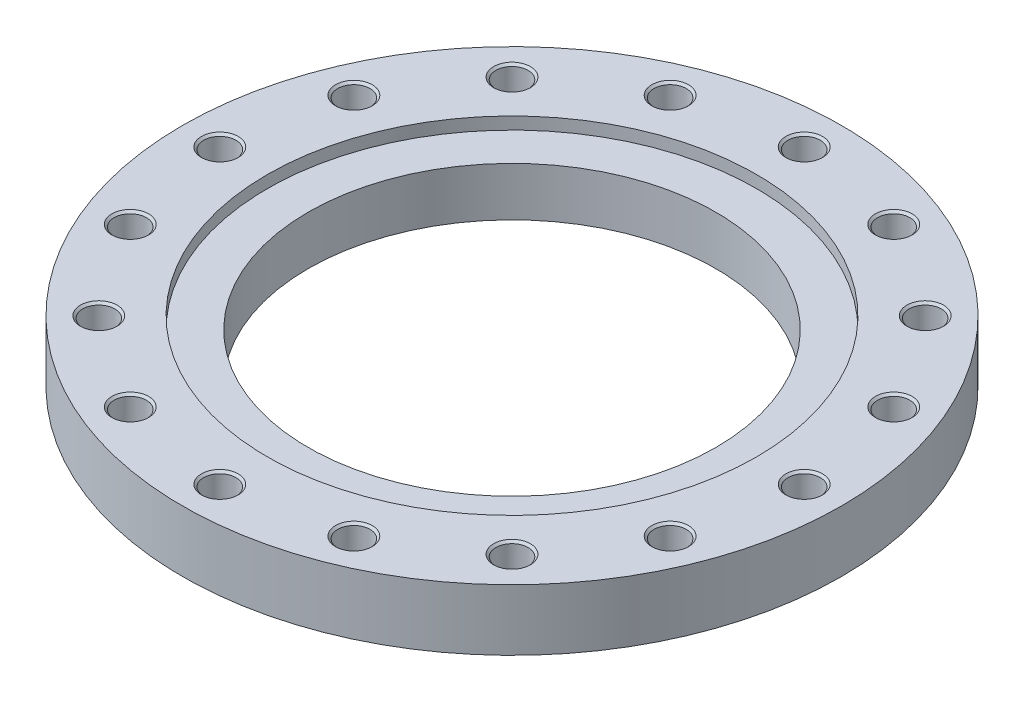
ISO-10303-21;
HEADER;
FILE_DESCRIPTION(('STEP AP214'),'2;1');
FILE_NAME('part.step','',(''),(''),'','','');
FILE_SCHEMA(('AUTOMOTIVE_DESIGN { 1 0 10303 214 1 1 1 1 }'));
ENDSEC;
DATA;
#1=APPLICATION_CONTEXT('core data for automotive mechanical design processes');
#2=APPLICATION_PROTOCOL_DEFINITION('international standard','automotive_design',2000,#1);
#3=PRODUCT_CONTEXT('',#1,'mechanical');
#4=PRODUCT('Part','Part','',(#3));
#5=PRODUCT_RELATED_PRODUCT_CATEGORY('part','',(#4));
#6=PRODUCT_DEFINITION_FORMATION('','',#4);
#7=PRODUCT_DEFINITION_CONTEXT('part definition',#1,'design');
#8=PRODUCT_DEFINITION('design','',#6,#7);
#9=PRODUCT_DEFINITION_SHAPE('','',#8);
#10=(LENGTH_UNIT() NAMED_UNIT(*) SI_UNIT(.MILLI.,.METRE.));
#11=(NAMED_UNIT(*) PLANE_ANGLE_UNIT() SI_UNIT($,.RADIAN.));
#12=(NAMED_UNIT(*) SI_UNIT($,.STERADIAN.) SOLID_ANGLE_UNIT());
#13=UNCERTAINTY_MEASURE_WITH_UNIT(LENGTH_MEASURE(1.E-05),#10,'distance_accuracy_value','');
#14=(GEOMETRIC_REPRESENTATION_CONTEXT(3) GLOBAL_UNCERTAINTY_ASSIGNED_CONTEXT((#13)) GLOBAL_UNIT_ASSIGNED_CONTEXT((#10,
#11,#12)) REPRESENTATION_CONTEXT('',''));
#15=CARTESIAN_POINT('',(0.,0.,0.));
#16=DIRECTION('',(0.,0.,1.));
#17=DIRECTION('',(1.,0.,0.));
#18=AXIS2_PLACEMENT_3D('',#15,#16,#17);
#19=CARTESIAN_POINT('',(0.,22.5,0.));
#20=DIRECTION('',(0.,-1.,0.));
#21=DIRECTION('',(1.,0.,0.));
#22=AXIS2_PLACEMENT_3D('',#19,#20,#21);
#23=CYLINDRICAL_SURFACE('',#22,242.5);
#24=CARTESIAN_POINT('',(0.,0.,0.));
#25=DIRECTION('',(0.,1.,0.));
#26=DIRECTION('',(1.,0.,0.));
#27=AXIS2_PLACEMENT_3D('',#24,#25,#26);
#28=CIRCLE('',#27,242.5);
#29=CARTESIAN_POINT('',(242.5,0.,0.));
#30=VERTEX_POINT('',#29);
#31=EDGE_CURVE('E9',#30,#30,#28,.T.);
#32=ORIENTED_EDGE('',*,*,#31,.T.);
#33=EDGE_LOOP('',(#32));
#34=FACE_BOUND('',#33,.T.);
#35=CARTESIAN_POINT('',(0.,45.,0.));
#36=DIRECTION('',(0.,1.,0.));
#37=DIRECTION('',(1.,0.,0.));
#38=AXIS2_PLACEMENT_3D('',#35,#36,#37);
#39=CIRCLE('',#38,242.5);
#40=CARTESIAN_POINT('',(242.5,45.,0.));
#41=VERTEX_POINT('',#40);
#42=EDGE_CURVE('E18',#41,#41,#39,.T.);
#43=ORIENTED_EDGE('',*,*,#42,.F.);
#44=EDGE_LOOP('',(#43));
#45=FACE_BOUND('',#44,.T.);
#46=ADVANCED_FACE('F15',(#34,#45),#23,.T.);
#47=CARTESIAN_POINT('',(196.25,0.,0.));
#48=DIRECTION('',(0.,-1.,0.));
#49=DIRECTION('',(-1.,0.,0.));
#50=AXIS2_PLACEMENT_3D('',#47,#48,#49);
#51=PLANE('',#50);
#52=CARTESIAN_POINT('',(0.,0.,0.));
#53=DIRECTION('',(0.,1.,0.));
#54=DIRECTION('',(1.,0.,0.));
#55=AXIS2_PLACEMENT_3D('',#52,#53,#54);
#56=CIRCLE('',#55,150.);
#57=CARTESIAN_POINT('',(150.,0.,0.));
#58=VERTEX_POINT('',#57);
#59=EDGE_CURVE('E24',#58,#58,#56,.T.);
#60=ORIENTED_EDGE('',*,*,#59,.T.);
#61=EDGE_LOOP('',(#60));
#62=FACE_BOUND('',#61,.T.);
#63=ORIENTED_EDGE('',*,*,#31,.F.);
#64=EDGE_LOOP('',(#63));
#65=FACE_BOUND('',#64,.T.);
#66=ADVANCED_FACE('F532',(#62,#65),#51,.T.);
#67=CARTESIAN_POINT('',(0.,22.5,0.));
#68=DIRECTION('',(0.,-1.,0.));
#69=DIRECTION('',(1.,0.,0.));
#70=AXIS2_PLACEMENT_3D('',#67,#68,#69);
#71=CYLINDRICAL_SURFACE('',#70,150.);
#72=ORIENTED_EDGE('',*,*,#59,.F.);
#73=EDGE_LOOP('',(#72));
#74=FACE_BOUND('',#73,.T.);
#75=CARTESIAN_POINT('',(0.,36.,0.));
#76=DIRECTION('',(0.,1.,0.));
#77=DIRECTION('',(1.,0.,0.));
#78=AXIS2_PLACEMENT_3D('',#75,#76,#77);
#79=CIRCLE('',#78,150.);
#80=CARTESIAN_POINT('',(-150.,36.,0.));
#81=VERTEX_POINT('',#80);
#82=EDGE_CURVE('E377',#81,#81,#79,.T.);
#83=ORIENTED_EDGE('',*,*,#82,.T.);
#84=EDGE_LOOP('',(#83));
#85=FACE_BOUND('',#84,.T.);
#86=ADVANCED_FACE('F536',(#74,#85),#71,.F.);
#87=CARTESIAN_POINT('',(196.25,45.,0.));
#88=DIRECTION('',(0.,1.,0.));
#89=DIRECTION('',(1.,0.,0.));
#90=AXIS2_PLACEMENT_3D('',#87,#88,#89);
#91=PLANE('',#90);
#92=ORIENTED_EDGE('',*,*,#42,.T.);
#93=EDGE_LOOP('',(#92));
#94=FACE_BOUND('',#93,.T.);
#95=CARTESIAN_POINT('',(0.,45.,0.));
#96=DIRECTION('',(0.,-1.,0.));
#97=DIRECTION('',(1.,0.,0.));
#98=AXIS2_PLACEMENT_3D('',#95,#96,#97);
#99=CIRCLE('',#98,180.);
#100=CARTESIAN_POINT('',(-180.,45.,0.));
#101=VERTEX_POINT('',#100);
#102=EDGE_CURVE('E155',#101,#101,#99,.T.);
#103=ORIENTED_EDGE('',*,*,#102,.T.);
#104=EDGE_LOOP('',(#103));
#105=FACE_BOUND('',#104,.T.);
#106=CARTESIAN_POINT('',(215.,45.,0.));
#107=DIRECTION('',(0.,-1.,0.));
#108=DIRECTION('',(1.,0.,0.));
#109=AXIS2_PLACEMENT_3D('',#106,#107,#108);
#110=CIRCLE('',#109,13.5);
#111=CARTESIAN_POINT('',(228.5,45.,0.));
#112=VERTEX_POINT('',#111);
#113=EDGE_CURVE('E448',#112,#112,#110,.T.);
#114=ORIENTED_EDGE('',*,*,#113,.T.);
#115=EDGE_LOOP('',(#114));
#116=FACE_BOUND('',#115,.T.);
#117=CARTESIAN_POINT('',(198.634099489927,45.,-82.2769379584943));
#118=DIRECTION('',(0.,-1.,0.));
#119=DIRECTION('',(0.923879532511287,0.,-0.38268343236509));
#120=AXIS2_PLACEMENT_3D('',#117,#118,#119);
#121=CIRCLE('',#120,13.5);
#122=CARTESIAN_POINT('',(211.106473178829,45.,-87.443164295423));
#123=VERTEX_POINT('',#122);
#124=EDGE_CURVE('E408',#123,#123,#121,.T.);
#125=ORIENTED_EDGE('',*,*,#124,.T.);
#126=EDGE_LOOP('',(#125));
#127=FACE_BOUND('',#126,.T.);
#128=CARTESIAN_POINT('',(152.027957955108,45.,-152.027957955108));
#129=DIRECTION('',(0.,-1.,0.));
#130=DIRECTION('',(0.707106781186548,0.,-0.707106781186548));
#131=AXIS2_PLACEMENT_3D('',#128,#129,#130);
#132=CIRCLE('',#131,13.5);
#133=CARTESIAN_POINT('',(161.573899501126,45.,-161.573899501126));
#134=VERTEX_POINT('',#133);
#135=EDGE_CURVE('E432',#134,#134,#132,.T.);
#136=ORIENTED_EDGE('',*,*,#135,.T.);
#137=EDGE_LOOP('',(#136));
#138=FACE_BOUND('',#137,.T.);
#139=CARTESIAN_POINT('',(82.2769379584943,45.,-198.634099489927));
#140=DIRECTION('',(0.,-1.,0.));
#141=DIRECTION('',(0.38268343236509,0.,-0.923879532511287));
#142=AXIS2_PLACEMENT_3D('',#139,#140,#141);
#143=CIRCLE('',#142,13.5);
#144=CARTESIAN_POINT('',(87.443164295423,45.,-211.106473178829));
#145=VERTEX_POINT('',#144);
#146=EDGE_CURVE('E417',#145,#145,#143,.T.);
#147=ORIENTED_EDGE('',*,*,#146,.T.);
#148=EDGE_LOOP('',(#147));
#149=FACE_BOUND('',#148,.T.);
#150=CARTESIAN_POINT('',(0.,45.,-215.));
#151=DIRECTION('',(0.,-1.,0.));
#152=DIRECTION('',(0.,0.,-1.));
#153=AXIS2_PLACEMENT_3D('',#150,#151,#152);
#154=CIRCLE('',#153,13.5);
#155=CARTESIAN_POINT('',(0.,45.,-228.5));
#156=VERTEX_POINT('',#155);
#157=EDGE_CURVE('E400',#156,#156,#154,.T.);
#158=ORIENTED_EDGE('',*,*,#157,.T.);
#159=EDGE_LOOP('',(#158));
#160=FACE_BOUND('',#159,.T.);
#161=CARTESIAN_POINT('',(-82.2769379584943,45.,-198.634099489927));
#162=DIRECTION('',(0.,-1.,0.));
#163=DIRECTION('',(-0.38268343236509,0.,-0.923879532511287));
#164=AXIS2_PLACEMENT_3D('',#161,#162,#163);
#165=CIRCLE('',#164,13.5);
#166=CARTESIAN_POINT('',(-87.443164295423,45.,-211.106473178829));
#167=VERTEX_POINT('',#166);
#168=EDGE_CURVE('E393',#167,#167,#165,.T.);
#169=ORIENTED_EDGE('',*,*,#168,.T.);
#170=EDGE_LOOP('',(#169));
#171=FACE_BOUND('',#170,.T.);
#172=CARTESIAN_POINT('',(-152.027957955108,45.,-152.027957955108));
#173=DIRECTION('',(0.,-1.,0.));
#174=DIRECTION('',(-0.707106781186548,0.,-0.707106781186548));
#175=AXIS2_PLACEMENT_3D('',#172,#173,#174);
#176=CIRCLE('',#175,13.5);
#177=CARTESIAN_POINT('',(-161.573899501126,45.,-161.573899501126));
#178=VERTEX_POINT('',#177);
#179=EDGE_CURVE('E381',#178,#178,#176,.T.);
#180=ORIENTED_EDGE('',*,*,#179,.T.);
#181=EDGE_LOOP('',(#180));
#182=FACE_BOUND('',#181,.T.);
#183=CARTESIAN_POINT('',(-198.634099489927,45.,-82.2769379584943));
#184=DIRECTION('',(0.,-1.,0.));
#185=DIRECTION('',(-0.923879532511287,0.,-0.38268343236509));
#186=AXIS2_PLACEMENT_3D('',#183,#184,#185);
#187=CIRCLE('',#186,13.5);
#188=CARTESIAN_POINT('',(-211.106473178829,45.,-87.443164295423));
#189=VERTEX_POINT('',#188);
#190=EDGE_CURVE('E373',#189,#189,#187,.T.);
#191=ORIENTED_EDGE('',*,*,#190,.T.);
#192=EDGE_LOOP('',(#191));
#193=FACE_BOUND('',#192,.T.);
#194=CARTESIAN_POINT('',(-215.,45.,0.));
#195=DIRECTION('',(0.,-1.,0.));
#196=DIRECTION('',(-1.,0.,0.));
#197=AXIS2_PLACEMENT_3D('',#194,#195,#196);
#198=CIRCLE('',#197,13.5);
#199=CARTESIAN_POINT('',(-228.5,45.,0.));
#200=VERTEX_POINT('',#199);
#201=EDGE_CURVE('E498',#200,#200,#198,.T.);
#202=ORIENTED_EDGE('',*,*,#201,.T.);
#203=EDGE_LOOP('',(#202));
#204=FACE_BOUND('',#203,.T.);
#205=CARTESIAN_POINT('',(-198.634099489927,45.,82.2769379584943));
#206=DIRECTION('',(0.,-1.,0.));
#207=DIRECTION('',(-0.923879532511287,0.,0.38268343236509));
#208=AXIS2_PLACEMENT_3D('',#205,#206,#207);
#209=CIRCLE('',#208,13.5);
#210=CARTESIAN_POINT('',(-211.106473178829,45.,87.443164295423));
#211=VERTEX_POINT('',#210);
#212=EDGE_CURVE('E480',#211,#211,#209,.T.);
#213=ORIENTED_EDGE('',*,*,#212,.T.);
#214=EDGE_LOOP('',(#213));
#215=FACE_BOUND('',#214,.T.);
#216=CARTESIAN_POINT('',(-152.027957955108,45.,152.027957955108));
#217=DIRECTION('',(0.,-1.,0.));
#218=DIRECTION('',(-0.707106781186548,0.,0.707106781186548));
#219=AXIS2_PLACEMENT_3D('',#216,#217,#218);
#220=CIRCLE('',#219,13.5);
#221=CARTESIAN_POINT('',(-161.573899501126,45.,161.573899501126));
#222=VERTEX_POINT('',#221);
#223=EDGE_CURVE('E466',#222,#222,#220,.T.);
#224=ORIENTED_EDGE('',*,*,#223,.T.);
#225=EDGE_LOOP('',(#224));
#226=FACE_BOUND('',#225,.T.);
#227=CARTESIAN_POINT('',(-82.2769379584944,45.,198.634099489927));
#228=DIRECTION('',(0.,-1.,0.));
#229=DIRECTION('',(-0.382683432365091,0.,0.923879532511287));
#230=AXIS2_PLACEMENT_3D('',#227,#228,#229);
#231=CIRCLE('',#230,13.5);
#232=CARTESIAN_POINT('',(-87.4431642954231,45.,211.106473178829));
#233=VERTEX_POINT('',#232);
#234=EDGE_CURVE('E455',#233,#233,#231,.T.);
#235=ORIENTED_EDGE('',*,*,#234,.T.);
#236=EDGE_LOOP('',(#235));
#237=FACE_BOUND('',#236,.T.);
#238=CARTESIAN_POINT('',(0.,45.,215.));
#239=DIRECTION('',(0.,-1.,0.));
#240=DIRECTION('',(0.,0.,1.));
#241=AXIS2_PLACEMENT_3D('',#238,#239,#240);
#242=CIRCLE('',#241,13.5);
#243=CARTESIAN_POINT('',(0.,45.,228.5));
#244=VERTEX_POINT('',#243);
#245=EDGE_CURVE('E735',#244,#244,#242,.T.);
#246=ORIENTED_EDGE('',*,*,#245,.T.);
#247=EDGE_LOOP('',(#246));
#248=FACE_BOUND('',#247,.T.);
#249=CARTESIAN_POINT('',(82.2769379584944,45.,198.634099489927));
#250=DIRECTION('',(0.,-1.,0.));
#251=DIRECTION('',(0.38268343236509,0.,0.923879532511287));
#252=AXIS2_PLACEMENT_3D('',#249,#250,#251);
#253=CIRCLE('',#252,13.5);
#254=CARTESIAN_POINT('',(87.4431642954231,45.,211.106473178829));
#255=VERTEX_POINT('',#254);
#256=EDGE_CURVE('E712',#255,#255,#253,.T.);
#257=ORIENTED_EDGE('',*,*,#256,.T.);
#258=EDGE_LOOP('',(#257));
#259=FACE_BOUND('',#258,.T.);
#260=CARTESIAN_POINT('',(152.027957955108,45.,152.027957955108));
#261=DIRECTION('',(0.,-1.,0.));
#262=DIRECTION('',(0.707106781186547,0.,0.707106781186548));
#263=AXIS2_PLACEMENT_3D('',#260,#261,#262);
#264=CIRCLE('',#263,13.5);
#265=CARTESIAN_POINT('',(161.573899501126,45.,161.573899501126));
#266=VERTEX_POINT('',#265);
#267=EDGE_CURVE('E722',#266,#266,#264,.T.);
#268=ORIENTED_EDGE('',*,*,#267,.T.);
#269=EDGE_LOOP('',(#268));
#270=FACE_BOUND('',#269,.T.);
#271=CARTESIAN_POINT('',(198.634099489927,45.,82.2769379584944));
#272=DIRECTION('',(0.,-1.,0.));
#273=DIRECTION('',(0.923879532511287,0.,0.382683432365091));
#274=AXIS2_PLACEMENT_3D('',#271,#272,#273);
#275=CIRCLE('',#274,13.5);
#276=CARTESIAN_POINT('',(211.106473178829,45.,87.4431642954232));
#277=VERTEX_POINT('',#276);
#278=EDGE_CURVE('E1657',#277,#277,#275,.T.);
#279=ORIENTED_EDGE('',*,*,#278,.T.);
#280=EDGE_LOOP('',(#279));
#281=FACE_BOUND('',#280,.T.);
#282=ADVANCED_FACE('F511',(#94,#105,#116,#127,#138,#149,#160,#171,#182,#193,#204,#215,#226,#237,
#248,#259,#270,#281),#91,.T.);
#283=CARTESIAN_POINT('',(0.,36.,0.));
#284=DIRECTION('',(0.,-1.,0.));
#285=DIRECTION('',(-1.,0.,0.));
#286=AXIS2_PLACEMENT_3D('',#283,#284,#285);
#287=PLANE('',#286);
#288=CARTESIAN_POINT('',(0.,36.,0.));
#289=DIRECTION('',(0.,-1.,0.));
#290=DIRECTION('',(1.,0.,0.));
#291=AXIS2_PLACEMENT_3D('',#288,#289,#290);
#292=CIRCLE('',#291,180.);
#293=CARTESIAN_POINT('',(180.,36.,0.));
#294=VERTEX_POINT('',#293);
#295=EDGE_CURVE('E450',#294,#294,#292,.T.);
#296=ORIENTED_EDGE('',*,*,#295,.F.);
#297=EDGE_LOOP('',(#296));
#298=FACE_BOUND('',#297,.T.);
#299=ORIENTED_EDGE('',*,*,#82,.F.);
#300=EDGE_LOOP('',(#299));
#301=FACE_BOUND('',#300,.T.);
#302=ADVANCED_FACE('F545',(#298,#301),#287,.F.);
#303=CARTESIAN_POINT('',(0.,42.75,0.));
#304=DIRECTION('',(0.,-1.,0.));
#305=DIRECTION('',(1.,0.,0.));
#306=AXIS2_PLACEMENT_3D('',#303,#304,#305);
#307=CYLINDRICAL_SURFACE('',#306,180.);
#308=ORIENTED_EDGE('',*,*,#295,.T.);
#309=EDGE_LOOP('',(#308));
#310=FACE_BOUND('',#309,.T.);
#311=ORIENTED_EDGE('',*,*,#102,.F.);
#312=EDGE_LOOP('',(#311));
#313=FACE_BOUND('',#312,.T.);
#314=ADVANCED_FACE('F547',(#310,#313),#307,.F.);
#315=CARTESIAN_POINT('',(215.,5.57162193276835,0.));
#316=DIRECTION('',(0.,1.,0.));
#317=DIRECTION('',(1.,0.,0.));
#318=AXIS2_PLACEMENT_3D('',#315,#316,#317);
#319=CONICAL_SURFACE('',#318,5.938125,1.0471975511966);
#320=CARTESIAN_POINT('',(215.,9.,0.));
#321=DIRECTION('',(0.,-1.,0.));
#322=DIRECTION('',(1.,0.,0.));
#323=AXIS2_PLACEMENT_3D('',#320,#321,#322);
#324=CIRCLE('',#323,11.87625);
#325=CARTESIAN_POINT('',(226.87625,9.,0.));
#326=VERTEX_POINT('',#325);
#327=EDGE_CURVE('E150',#326,#326,#324,.T.);
#328=ORIENTED_EDGE('',*,*,#327,.F.);
#329=EDGE_LOOP('',(#328));
#330=FACE_BOUND('',#329,.T.);
#331=CARTESIAN_POINT('',(215.,2.1432438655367,0.));
#332=VERTEX_POINT('',#331);
#333=VERTEX_LOOP('',#332);
#334=FACE_BOUND('',#333,.T.);
#335=ADVANCED_FACE('F553',(#330,#334),#319,.F.);
#336=CARTESIAN_POINT('',(215.,13.688125,0.));
#337=DIRECTION('',(0.,1.,0.));
#338=DIRECTION('',(1.,0.,0.));
#339=AXIS2_PLACEMENT_3D('',#336,#337,#338);
#340=CYLINDRICAL_SURFACE('',#339,11.87625);
#341=CARTESIAN_POINT('',(215.,18.37625,0.));
#342=DIRECTION('',(0.,-1.,0.));
#343=DIRECTION('',(1.,0.,0.));
#344=AXIS2_PLACEMENT_3D('',#341,#342,#343);
#345=CIRCLE('',#344,11.87625);
#346=CARTESIAN_POINT('',(226.87625,18.37625,0.));
#347=VERTEX_POINT('',#346);
#348=EDGE_CURVE('E427',#347,#347,#345,.T.);
#349=ORIENTED_EDGE('',*,*,#348,.F.);
#350=EDGE_LOOP('',(#349));
#351=FACE_BOUND('',#350,.T.);
#352=ORIENTED_EDGE('',*,*,#327,.T.);
#353=EDGE_LOOP('',(#352));
#354=FACE_BOUND('',#353,.T.);
#355=ADVANCED_FACE('F561',(#351,#354),#340,.F.);
#356=CARTESIAN_POINT('',(215.,19.188125,0.));
#357=DIRECTION('',(0.,1.,0.));
#358=DIRECTION('',(1.,0.,0.));
#359=AXIS2_PLACEMENT_3D('',#356,#357,#358);
#360=CONICAL_SURFACE('',#359,12.688125,0.785398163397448);
#361=CARTESIAN_POINT('',(215.,20.,0.));
#362=DIRECTION('',(0.,-1.,0.));
#363=DIRECTION('',(1.,0.,0.));
#364=AXIS2_PLACEMENT_3D('',#361,#362,#363);
#365=CIRCLE('',#364,13.5);
#366=CARTESIAN_POINT('',(228.5,20.,0.));
#367=VERTEX_POINT('',#366);
#368=EDGE_CURVE('E429',#367,#367,#365,.T.);
#369=ORIENTED_EDGE('',*,*,#368,.F.);
#370=EDGE_LOOP('',(#369));
#371=FACE_BOUND('',#370,.T.);
#372=ORIENTED_EDGE('',*,*,#348,.T.);
#373=EDGE_LOOP('',(#372));
#374=FACE_BOUND('',#373,.T.);
#375=ADVANCED_FACE('F563',(#371,#374),#360,.F.);
#376=CARTESIAN_POINT('',(227.688125,20.,0.));
#377=DIRECTION('',(0.,1.,0.));
#378=DIRECTION('',(-1.,0.,0.));
#379=AXIS2_PLACEMENT_3D('',#376,#377,#378);
#380=PLANE('',#379);
#381=CARTESIAN_POINT('',(215.,20.,0.));
#382=DIRECTION('',(0.,-1.,0.));
#383=DIRECTION('',(1.,0.,0.));
#384=AXIS2_PLACEMENT_3D('',#381,#382,#383);
#385=CIRCLE('',#384,11.87625);
#386=CARTESIAN_POINT('',(226.87625,20.,0.));
#387=VERTEX_POINT('',#386);
#388=EDGE_CURVE('E449',#387,#387,#385,.T.);
#389=ORIENTED_EDGE('',*,*,#388,.F.);
#390=EDGE_LOOP('',(#389));
#391=FACE_BOUND('',#390,.T.);
#392=ORIENTED_EDGE('',*,*,#368,.T.);
#393=EDGE_LOOP('',(#392));
#394=FACE_BOUND('',#393,.T.);
#395=ADVANCED_FACE('F566',(#391,#394),#380,.F.);
#396=CARTESIAN_POINT('',(215.,31.688125,0.));
#397=DIRECTION('',(0.,1.,0.));
#398=DIRECTION('',(1.,0.,0.));
#399=AXIS2_PLACEMENT_3D('',#396,#397,#398);
#400=CYLINDRICAL_SURFACE('',#399,11.87625);
#401=CARTESIAN_POINT('',(215.,43.37625,0.));
#402=DIRECTION('',(0.,-1.,0.));
#403=DIRECTION('',(1.,0.,0.));
#404=AXIS2_PLACEMENT_3D('',#401,#402,#403);
#405=CIRCLE('',#404,11.87625);
#406=CARTESIAN_POINT('',(226.87625,43.37625,0.));
#407=VERTEX_POINT('',#406);
#408=EDGE_CURVE('E446',#407,#407,#405,.T.);
#409=ORIENTED_EDGE('',*,*,#408,.F.);
#410=EDGE_LOOP('',(#409));
#411=FACE_BOUND('',#410,.T.);
#412=ORIENTED_EDGE('',*,*,#388,.T.);
#413=EDGE_LOOP('',(#412));
#414=FACE_BOUND('',#413,.T.);
#415=ADVANCED_FACE('F617',(#411,#414),#400,.F.);
#416=CARTESIAN_POINT('',(215.,44.188125,0.));
#417=DIRECTION('',(0.,1.,0.));
#418=DIRECTION('',(1.,0.,0.));
#419=AXIS2_PLACEMENT_3D('',#416,#417,#418);
#420=CONICAL_SURFACE('',#419,12.688125,0.785398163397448);
#421=ORIENTED_EDGE('',*,*,#113,.F.);
#422=EDGE_LOOP('',(#421));
#423=FACE_BOUND('',#422,.T.);
#424=ORIENTED_EDGE('',*,*,#408,.T.);
#425=EDGE_LOOP('',(#424));
#426=FACE_BOUND('',#425,.T.);
#427=ADVANCED_FACE('F572',(#423,#426),#420,.F.);
#428=CARTESIAN_POINT('',(198.634099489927,5.57162193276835,-82.2769379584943));
#429=DIRECTION('',(0.,1.,0.));
#430=DIRECTION('',(0.923879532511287,0.,-0.38268343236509));
#431=AXIS2_PLACEMENT_3D('',#428,#429,#430);
#432=CONICAL_SURFACE('',#431,5.938125,1.0471975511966);
#433=CARTESIAN_POINT('',(198.634099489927,9.,-82.2769379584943));
#434=DIRECTION('',(0.,-1.,0.));
#435=DIRECTION('',(0.923879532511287,0.,-0.38268343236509));
#436=AXIS2_PLACEMENT_3D('',#433,#434,#435);
#437=CIRCLE('',#436,11.87625);
#438=CARTESIAN_POINT('',(209.606323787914,9.,-86.8217820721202));
#439=VERTEX_POINT('',#438);
#440=EDGE_CURVE('E443',#439,#439,#437,.T.);
#441=ORIENTED_EDGE('',*,*,#440,.F.);
#442=EDGE_LOOP('',(#441));
#443=FACE_BOUND('',#442,.T.);
#444=CARTESIAN_POINT('',(198.634099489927,2.1432438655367,-82.2769379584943));
#445=VERTEX_POINT('',#444);
#446=VERTEX_LOOP('',#445);
#447=FACE_BOUND('',#446,.T.);
#448=ADVANCED_FACE('F568',(#443,#447),#432,.F.);
#449=CARTESIAN_POINT('',(198.634099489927,13.688125,-82.2769379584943));
#450=DIRECTION('',(0.,1.,0.));
#451=DIRECTION('',(0.923879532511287,0.,-0.38268343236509));
#452=AXIS2_PLACEMENT_3D('',#449,#450,#451);
#453=CYLINDRICAL_SURFACE('',#452,11.87625);
#454=CARTESIAN_POINT('',(198.634099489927,18.37625,-82.2769379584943));
#455=DIRECTION('',(0.,-1.,0.));
#456=DIRECTION('',(0.923879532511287,0.,-0.38268343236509));
#457=AXIS2_PLACEMENT_3D('',#454,#455,#456);
#458=CIRCLE('',#457,11.87625);
#459=CARTESIAN_POINT('',(209.606323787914,18.37625,-86.8217820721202));
#460=VERTEX_POINT('',#459);
#461=EDGE_CURVE('E441',#460,#460,#458,.T.);
#462=ORIENTED_EDGE('',*,*,#461,.F.);
#463=EDGE_LOOP('',(#462));
#464=FACE_BOUND('',#463,.T.);
#465=ORIENTED_EDGE('',*,*,#440,.T.);
#466=EDGE_LOOP('',(#465));
#467=FACE_BOUND('',#466,.T.);
#468=ADVANCED_FACE('F571',(#464,#467),#453,.F.);
#469=CARTESIAN_POINT('',(198.634099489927,19.188125,-82.2769379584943));
#470=DIRECTION('',(0.,1.,0.));
#471=DIRECTION('',(0.923879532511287,0.,-0.38268343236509));
#472=AXIS2_PLACEMENT_3D('',#469,#470,#471);
#473=CONICAL_SURFACE('',#472,12.688125,0.785398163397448);
#474=CARTESIAN_POINT('',(198.634099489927,20.,-82.2769379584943));
#475=DIRECTION('',(0.,-1.,0.));
#476=DIRECTION('',(0.923879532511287,0.,-0.38268343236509));
#477=AXIS2_PLACEMENT_3D('',#474,#475,#476);
#478=CIRCLE('',#477,13.5);
#479=CARTESIAN_POINT('',(211.106473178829,20.,-87.443164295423));
#480=VERTEX_POINT('',#479);
#481=EDGE_CURVE('E444',#480,#480,#478,.T.);
#482=ORIENTED_EDGE('',*,*,#481,.F.);
#483=EDGE_LOOP('',(#482));
#484=FACE_BOUND('',#483,.T.);
#485=ORIENTED_EDGE('',*,*,#461,.T.);
#486=EDGE_LOOP('',(#485));
#487=FACE_BOUND('',#486,.T.);
#488=ADVANCED_FACE('F578',(#484,#487),#473,.F.);
#489=CARTESIAN_POINT('',(210.356398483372,20.,-87.1324731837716));
#490=DIRECTION('',(0.,1.,0.));
#491=DIRECTION('',(-0.923879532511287,0.,0.38268343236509));
#492=AXIS2_PLACEMENT_3D('',#489,#490,#491);
#493=PLANE('',#492);
#494=CARTESIAN_POINT('',(198.634099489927,20.,-82.2769379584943));
#495=DIRECTION('',(0.,-1.,0.));
#496=DIRECTION('',(0.923879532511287,0.,-0.38268343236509));
#497=AXIS2_PLACEMENT_3D('',#494,#495,#496);
#498=CIRCLE('',#497,11.87625);
#499=CARTESIAN_POINT('',(209.606323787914,20.,-86.8217820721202));
#500=VERTEX_POINT('',#499);
#501=EDGE_CURVE('E470',#500,#500,#498,.T.);
#502=ORIENTED_EDGE('',*,*,#501,.F.);
#503=EDGE_LOOP('',(#502));
#504=FACE_BOUND('',#503,.T.);
#505=ORIENTED_EDGE('',*,*,#481,.T.);
#506=EDGE_LOOP('',(#505));
#507=FACE_BOUND('',#506,.T.);
#508=ADVANCED_FACE('F574',(#504,#507),#493,.F.);
#509=CARTESIAN_POINT('',(198.634099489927,31.688125,-82.2769379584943));
#510=DIRECTION('',(0.,1.,0.));
#511=DIRECTION('',(0.923879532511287,0.,-0.38268343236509));
#512=AXIS2_PLACEMENT_3D('',#509,#510,#511);
#513=CYLINDRICAL_SURFACE('',#512,11.87625);
#514=CARTESIAN_POINT('',(198.634099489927,43.37625,-82.2769379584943));
#515=DIRECTION('',(0.,-1.,0.));
#516=DIRECTION('',(0.923879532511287,0.,-0.38268343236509));
#517=AXIS2_PLACEMENT_3D('',#514,#515,#516);
#518=CIRCLE('',#517,11.87625);
#519=CARTESIAN_POINT('',(209.606323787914,43.37625,-86.8217820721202));
#520=VERTEX_POINT('',#519);
#521=EDGE_CURVE('E406',#520,#520,#518,.T.);
#522=ORIENTED_EDGE('',*,*,#521,.F.);
#523=EDGE_LOOP('',(#522));
#524=FACE_BOUND('',#523,.T.);
#525=ORIENTED_EDGE('',*,*,#501,.T.);
#526=EDGE_LOOP('',(#525));
#527=FACE_BOUND('',#526,.T.);
#528=ADVANCED_FACE('F577',(#524,#527),#513,.F.);
#529=CARTESIAN_POINT('',(198.634099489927,44.188125,-82.2769379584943));
#530=DIRECTION('',(0.,1.,0.));
#531=DIRECTION('',(0.923879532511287,0.,-0.38268343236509));
#532=AXIS2_PLACEMENT_3D('',#529,#530,#531);
#533=CONICAL_SURFACE('',#532,12.688125,0.785398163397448);
#534=ORIENTED_EDGE('',*,*,#124,.F.);
#535=EDGE_LOOP('',(#534));
#536=FACE_BOUND('',#535,.T.);
#537=ORIENTED_EDGE('',*,*,#521,.T.);
#538=EDGE_LOOP('',(#537));
#539=FACE_BOUND('',#538,.T.);
#540=ADVANCED_FACE('F783',(#536,#539),#533,.F.);
#541=CARTESIAN_POINT('',(152.027957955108,5.57162193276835,-152.027957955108));
#542=DIRECTION('',(0.,1.,0.));
#543=DIRECTION('',(0.707106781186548,0.,-0.707106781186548));
#544=AXIS2_PLACEMENT_3D('',#541,#542,#543);
#545=CONICAL_SURFACE('',#544,5.938125,1.0471975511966);
#546=CARTESIAN_POINT('',(152.027957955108,9.,-152.027957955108));
#547=DIRECTION('',(0.,-1.,0.));
#548=DIRECTION('',(0.707106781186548,0.,-0.707106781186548));
#549=AXIS2_PLACEMENT_3D('',#546,#547,#548);
#550=CIRCLE('',#549,11.87625);
#551=CARTESIAN_POINT('',(160.425734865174,9.,-160.425734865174));
#552=VERTEX_POINT('',#551);
#553=EDGE_CURVE('E409',#552,#552,#550,.T.);
#554=ORIENTED_EDGE('',*,*,#553,.F.);
#555=EDGE_LOOP('',(#554));
#556=FACE_BOUND('',#555,.T.);
#557=CARTESIAN_POINT('',(152.027957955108,2.1432438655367,-152.027957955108));
#558=VERTEX_POINT('',#557);
#559=VERTEX_LOOP('',#558);
#560=FACE_BOUND('',#559,.T.);
#561=ADVANCED_FACE('F584',(#556,#560),#545,.F.);
#562=CARTESIAN_POINT('',(152.027957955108,13.688125,-152.027957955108));
#563=DIRECTION('',(0.,1.,0.));
#564=DIRECTION('',(0.707106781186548,0.,-0.707106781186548));
#565=AXIS2_PLACEMENT_3D('',#562,#563,#564);
#566=CYLINDRICAL_SURFACE('',#565,11.87625);
#567=CARTESIAN_POINT('',(152.027957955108,18.37625,-152.027957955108));
#568=DIRECTION('',(0.,-1.,0.));
#569=DIRECTION('',(0.707106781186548,0.,-0.707106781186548));
#570=AXIS2_PLACEMENT_3D('',#567,#568,#569);
#571=CIRCLE('',#570,11.87625);
#572=CARTESIAN_POINT('',(160.425734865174,18.37625,-160.425734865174));
#573=VERTEX_POINT('',#572);
#574=EDGE_CURVE('E438',#573,#573,#571,.T.);
#575=ORIENTED_EDGE('',*,*,#574,.F.);
#576=EDGE_LOOP('',(#575));
#577=FACE_BOUND('',#576,.T.);
#578=ORIENTED_EDGE('',*,*,#553,.T.);
#579=EDGE_LOOP('',(#578));
#580=FACE_BOUND('',#579,.T.);
#581=ADVANCED_FACE('F580',(#577,#580),#566,.F.);
#582=CARTESIAN_POINT('',(152.027957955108,19.188125,-152.027957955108));
#583=DIRECTION('',(0.,1.,0.));
#584=DIRECTION('',(0.707106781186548,0.,-0.707106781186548));
#585=AXIS2_PLACEMENT_3D('',#582,#583,#584);
#586=CONICAL_SURFACE('',#585,12.688125,0.785398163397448);
#587=CARTESIAN_POINT('',(152.027957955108,20.,-152.027957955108));
#588=DIRECTION('',(0.,-1.,0.));
#589=DIRECTION('',(0.707106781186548,0.,-0.707106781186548));
#590=AXIS2_PLACEMENT_3D('',#587,#588,#589);
#591=CIRCLE('',#590,13.5);
#592=CARTESIAN_POINT('',(161.573899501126,20.,-161.573899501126));
#593=VERTEX_POINT('',#592);
#594=EDGE_CURVE('E435',#593,#593,#591,.T.);
#595=ORIENTED_EDGE('',*,*,#594,.F.);
#596=EDGE_LOOP('',(#595));
#597=FACE_BOUND('',#596,.T.);
#598=ORIENTED_EDGE('',*,*,#574,.T.);
#599=EDGE_LOOP('',(#598));
#600=FACE_BOUND('',#599,.T.);
#601=ADVANCED_FACE('F583',(#597,#600),#586,.F.);
#602=CARTESIAN_POINT('',(160.99981718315,20.,-160.99981718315));
#603=DIRECTION('',(0.,1.,0.));
#604=DIRECTION('',(-0.707106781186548,0.,0.707106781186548));
#605=AXIS2_PLACEMENT_3D('',#602,#603,#604);
#606=PLANE('',#605);
#607=CARTESIAN_POINT('',(152.027957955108,20.,-152.027957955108));
#608=DIRECTION('',(0.,-1.,0.));
#609=DIRECTION('',(0.707106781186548,0.,-0.707106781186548));
#610=AXIS2_PLACEMENT_3D('',#607,#608,#609);
#611=CIRCLE('',#610,11.87625);
#612=CARTESIAN_POINT('',(160.425734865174,20.,-160.425734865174));
#613=VERTEX_POINT('',#612);
#614=EDGE_CURVE('E434',#613,#613,#611,.T.);
#615=ORIENTED_EDGE('',*,*,#614,.F.);
#616=EDGE_LOOP('',(#615));
#617=FACE_BOUND('',#616,.T.);
#618=ORIENTED_EDGE('',*,*,#594,.T.);
#619=EDGE_LOOP('',(#618));
#620=FACE_BOUND('',#619,.T.);
#621=ADVANCED_FACE('F588',(#617,#620),#606,.F.);
#622=CARTESIAN_POINT('',(152.027957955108,31.688125,-152.027957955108));
#623=DIRECTION('',(0.,1.,0.));
#624=DIRECTION('',(0.707106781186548,0.,-0.707106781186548));
#625=AXIS2_PLACEMENT_3D('',#622,#623,#624);
#626=CYLINDRICAL_SURFACE('',#625,11.87625);
#627=CARTESIAN_POINT('',(152.027957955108,43.37625,-152.027957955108));
#628=DIRECTION('',(0.,-1.,0.));
#629=DIRECTION('',(0.707106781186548,0.,-0.707106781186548));
#630=AXIS2_PLACEMENT_3D('',#627,#628,#629);
#631=CIRCLE('',#630,11.87625);
#632=CARTESIAN_POINT('',(160.425734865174,43.37625,-160.425734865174));
#633=VERTEX_POINT('',#632);
#634=EDGE_CURVE('E430',#633,#633,#631,.T.);
#635=ORIENTED_EDGE('',*,*,#634,.F.);
#636=EDGE_LOOP('',(#635));
#637=FACE_BOUND('',#636,.T.);
#638=ORIENTED_EDGE('',*,*,#614,.T.);
#639=EDGE_LOOP('',(#638));
#640=FACE_BOUND('',#639,.T.);
#641=ADVANCED_FACE('F592',(#637,#640),#626,.F.);
#642=CARTESIAN_POINT('',(152.027957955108,44.188125,-152.027957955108));
#643=DIRECTION('',(0.,1.,0.));
#644=DIRECTION('',(0.707106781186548,0.,-0.707106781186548));
#645=AXIS2_PLACEMENT_3D('',#642,#643,#644);
#646=CONICAL_SURFACE('',#645,12.688125,0.785398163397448);
#647=ORIENTED_EDGE('',*,*,#135,.F.);
#648=EDGE_LOOP('',(#647));
#649=FACE_BOUND('',#648,.T.);
#650=ORIENTED_EDGE('',*,*,#634,.T.);
#651=EDGE_LOOP('',(#650));
#652=FACE_BOUND('',#651,.T.);
#653=ADVANCED_FACE('F596',(#649,#652),#646,.F.);
#654=CARTESIAN_POINT('',(82.2769379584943,5.57162193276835,-198.634099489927));
#655=DIRECTION('',(0.,1.,0.));
#656=DIRECTION('',(0.38268343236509,0.,-0.923879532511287));
#657=AXIS2_PLACEMENT_3D('',#654,#655,#656);
#658=CONICAL_SURFACE('',#657,5.938125,1.0471975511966);
#659=CARTESIAN_POINT('',(82.2769379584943,9.,-198.634099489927));
#660=DIRECTION('',(0.,-1.,0.));
#661=DIRECTION('',(0.38268343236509,0.,-0.923879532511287));
#662=AXIS2_PLACEMENT_3D('',#659,#660,#661);
#663=CIRCLE('',#662,11.87625);
#664=CARTESIAN_POINT('',(86.8217820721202,9.,-209.606323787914));
#665=VERTEX_POINT('',#664);
#666=EDGE_CURVE('E426',#665,#665,#663,.T.);
#667=ORIENTED_EDGE('',*,*,#666,.F.);
#668=EDGE_LOOP('',(#667));
#669=FACE_BOUND('',#668,.T.);
#670=CARTESIAN_POINT('',(82.2769379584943,2.1432438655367,-198.634099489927));
#671=VERTEX_POINT('',#670);
#672=VERTEX_LOOP('',#671);
#673=FACE_BOUND('',#672,.T.);
#674=ADVANCED_FACE('F600',(#669,#673),#658,.F.);
#675=CARTESIAN_POINT('',(82.2769379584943,13.688125,-198.634099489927));
#676=DIRECTION('',(0.,1.,0.));
#677=DIRECTION('',(0.38268343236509,0.,-0.923879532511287));
#678=AXIS2_PLACEMENT_3D('',#675,#676,#677);
#679=CYLINDRICAL_SURFACE('',#678,11.87625);
#680=CARTESIAN_POINT('',(82.2769379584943,18.37625,-198.634099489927));
#681=DIRECTION('',(0.,-1.,0.));
#682=DIRECTION('',(0.38268343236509,0.,-0.923879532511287));
#683=AXIS2_PLACEMENT_3D('',#680,#681,#682);
#684=CIRCLE('',#683,11.87625);
#685=CARTESIAN_POINT('',(86.8217820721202,18.37625,-209.606323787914));
#686=VERTEX_POINT('',#685);
#687=EDGE_CURVE('E424',#686,#686,#684,.T.);
#688=ORIENTED_EDGE('',*,*,#687,.F.);
#689=EDGE_LOOP('',(#688));
#690=FACE_BOUND('',#689,.T.);
#691=ORIENTED_EDGE('',*,*,#666,.T.);
#692=EDGE_LOOP('',(#691));
#693=FACE_BOUND('',#692,.T.);
#694=ADVANCED_FACE('F604',(#690,#693),#679,.F.);
#695=CARTESIAN_POINT('',(82.2769379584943,19.188125,-198.634099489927));
#696=DIRECTION('',(0.,1.,0.));
#697=DIRECTION('',(0.38268343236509,0.,-0.923879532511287));
#698=AXIS2_PLACEMENT_3D('',#695,#696,#697);
#699=CONICAL_SURFACE('',#698,12.688125,0.785398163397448);
#700=CARTESIAN_POINT('',(82.2769379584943,20.,-198.634099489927));
#701=DIRECTION('',(0.,-1.,0.));
#702=DIRECTION('',(0.38268343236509,0.,-0.923879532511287));
#703=AXIS2_PLACEMENT_3D('',#700,#701,#702);
#704=CIRCLE('',#703,13.5);
#705=CARTESIAN_POINT('',(87.443164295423,20.,-211.106473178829));
#706=VERTEX_POINT('',#705);
#707=EDGE_CURVE('E421',#706,#706,#704,.T.);
#708=ORIENTED_EDGE('',*,*,#707,.F.);
#709=EDGE_LOOP('',(#708));
#710=FACE_BOUND('',#709,.T.);
#711=ORIENTED_EDGE('',*,*,#687,.T.);
#712=EDGE_LOOP('',(#711));
#713=FACE_BOUND('',#712,.T.);
#714=ADVANCED_FACE('F608',(#710,#713),#699,.F.);
#715=CARTESIAN_POINT('',(87.1324731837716,20.,-210.356398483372));
#716=DIRECTION('',(0.,1.,0.));
#717=DIRECTION('',(-0.38268343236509,0.,0.923879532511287));
#718=AXIS2_PLACEMENT_3D('',#715,#716,#717);
#719=PLANE('',#718);
#720=CARTESIAN_POINT('',(82.2769379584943,20.,-198.634099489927));
#721=DIRECTION('',(0.,-1.,0.));
#722=DIRECTION('',(0.38268343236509,0.,-0.923879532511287));
#723=AXIS2_PLACEMENT_3D('',#720,#721,#722);
#724=CIRCLE('',#723,11.87625);
#725=CARTESIAN_POINT('',(86.8217820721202,20.,-209.606323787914));
#726=VERTEX_POINT('',#725);
#727=EDGE_CURVE('E419',#726,#726,#724,.T.);
#728=ORIENTED_EDGE('',*,*,#727,.F.);
#729=EDGE_LOOP('',(#728));
#730=FACE_BOUND('',#729,.T.);
#731=ORIENTED_EDGE('',*,*,#707,.T.);
#732=EDGE_LOOP('',(#731));
#733=FACE_BOUND('',#732,.T.);
#734=ADVANCED_FACE('F610',(#730,#733),#719,.F.);
#735=CARTESIAN_POINT('',(82.2769379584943,31.688125,-198.634099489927));
#736=DIRECTION('',(0.,1.,0.));
#737=DIRECTION('',(0.38268343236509,0.,-0.923879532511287));
#738=AXIS2_PLACEMENT_3D('',#735,#736,#737);
#739=CYLINDRICAL_SURFACE('',#738,11.87625);
#740=CARTESIAN_POINT('',(82.2769379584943,43.37625,-198.634099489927));
#741=DIRECTION('',(0.,-1.,0.));
#742=DIRECTION('',(0.38268343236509,0.,-0.923879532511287));
#743=AXIS2_PLACEMENT_3D('',#740,#741,#742);
#744=CIRCLE('',#743,11.87625);
#745=CARTESIAN_POINT('',(86.8217820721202,43.37625,-209.606323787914));
#746=VERTEX_POINT('',#745);
#747=EDGE_CURVE('E415',#746,#746,#744,.T.);
#748=ORIENTED_EDGE('',*,*,#747,.F.);
#749=EDGE_LOOP('',(#748));
#750=FACE_BOUND('',#749,.T.);
#751=ORIENTED_EDGE('',*,*,#727,.T.);
#752=EDGE_LOOP('',(#751));
#753=FACE_BOUND('',#752,.T.);
#754=ADVANCED_FACE('F613',(#750,#753),#739,.F.);
#755=CARTESIAN_POINT('',(82.2769379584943,44.188125,-198.634099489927));
#756=DIRECTION('',(0.,1.,0.));
#757=DIRECTION('',(0.38268343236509,0.,-0.923879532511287));
#758=AXIS2_PLACEMENT_3D('',#755,#756,#757);
#759=CONICAL_SURFACE('',#758,12.688125,0.785398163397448);
#760=ORIENTED_EDGE('',*,*,#146,.F.);
#761=EDGE_LOOP('',(#760));
#762=FACE_BOUND('',#761,.T.);
#763=ORIENTED_EDGE('',*,*,#747,.T.);
#764=EDGE_LOOP('',(#763));
#765=FACE_BOUND('',#764,.T.);
#766=ADVANCED_FACE('F621',(#762,#765),#759,.F.);
#767=CARTESIAN_POINT('',(0.,5.57162193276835,-215.));
#768=DIRECTION('',(0.,1.,0.));
#769=DIRECTION('',(0.,0.,-1.));
#770=AXIS2_PLACEMENT_3D('',#767,#768,#769);
#771=CONICAL_SURFACE('',#770,5.938125,1.0471975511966);
#772=CARTESIAN_POINT('',(0.,9.,-215.));
#773=DIRECTION('',(0.,-1.,0.));
#774=DIRECTION('',(0.,0.,-1.));
#775=AXIS2_PLACEMENT_3D('',#772,#773,#774);
#776=CIRCLE('',#775,11.87625);
#777=CARTESIAN_POINT('',(0.,9.,-226.87625));
#778=VERTEX_POINT('',#777);
#779=EDGE_CURVE('E413',#778,#778,#776,.T.);
#780=ORIENTED_EDGE('',*,*,#779,.F.);
#781=EDGE_LOOP('',(#780));
#782=FACE_BOUND('',#781,.T.);
#783=CARTESIAN_POINT('',(0.,2.1432438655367,-215.));
#784=VERTEX_POINT('',#783);
#785=VERTEX_LOOP('',#784);
#786=FACE_BOUND('',#785,.T.);
#787=ADVANCED_FACE('F625',(#782,#786),#771,.F.);
#788=CARTESIAN_POINT('',(0.,13.688125,-215.));
#789=DIRECTION('',(0.,1.,0.));
#790=DIRECTION('',(0.,0.,-1.));
#791=AXIS2_PLACEMENT_3D('',#788,#789,#790);
#792=CYLINDRICAL_SURFACE('',#791,11.87625);
#793=CARTESIAN_POINT('',(0.,18.37625,-215.));
#794=DIRECTION('',(0.,-1.,0.));
#795=DIRECTION('',(0.,0.,-1.));
#796=AXIS2_PLACEMENT_3D('',#793,#794,#795);
#797=CIRCLE('',#796,11.87625);
#798=CARTESIAN_POINT('',(0.,18.37625,-226.87625));
#799=VERTEX_POINT('',#798);
#800=EDGE_CURVE('E411',#799,#799,#797,.T.);
#801=ORIENTED_EDGE('',*,*,#800,.F.);
#802=EDGE_LOOP('',(#801));
#803=FACE_BOUND('',#802,.T.);
#804=ORIENTED_EDGE('',*,*,#779,.T.);
#805=EDGE_LOOP('',(#804));
#806=FACE_BOUND('',#805,.T.);
#807=ADVANCED_FACE('F627',(#803,#806),#792,.F.);
#808=CARTESIAN_POINT('',(0.,19.188125,-215.));
#809=DIRECTION('',(0.,1.,0.));
#810=DIRECTION('',(0.,0.,-1.));
#811=AXIS2_PLACEMENT_3D('',#808,#809,#810);
#812=CONICAL_SURFACE('',#811,12.688125,0.785398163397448);
#813=CARTESIAN_POINT('',(0.,20.,-215.));
#814=DIRECTION('',(0.,-1.,0.));
#815=DIRECTION('',(0.,0.,-1.));
#816=AXIS2_PLACEMENT_3D('',#813,#814,#815);
#817=CIRCLE('',#816,13.5);
#818=CARTESIAN_POINT('',(0.,20.,-228.5));
#819=VERTEX_POINT('',#818);
#820=EDGE_CURVE('E404',#819,#819,#817,.T.);
#821=ORIENTED_EDGE('',*,*,#820,.F.);
#822=EDGE_LOOP('',(#821));
#823=FACE_BOUND('',#822,.T.);
#824=ORIENTED_EDGE('',*,*,#800,.T.);
#825=EDGE_LOOP('',(#824));
#826=FACE_BOUND('',#825,.T.);
#827=ADVANCED_FACE('F630',(#823,#826),#812,.F.);
#828=CARTESIAN_POINT('',(0.,20.,-227.688125));
#829=DIRECTION('',(0.,1.,0.));
#830=DIRECTION('',(0.,0.,1.));
#831=AXIS2_PLACEMENT_3D('',#828,#829,#830);
#832=PLANE('',#831);
#833=CARTESIAN_POINT('',(0.,20.,-215.));
#834=DIRECTION('',(0.,-1.,0.));
#835=DIRECTION('',(0.,0.,-1.));
#836=AXIS2_PLACEMENT_3D('',#833,#834,#835);
#837=CIRCLE('',#836,11.87625);
#838=CARTESIAN_POINT('',(0.,20.,-226.87625));
#839=VERTEX_POINT('',#838);
#840=EDGE_CURVE('E402',#839,#839,#837,.T.);
#841=ORIENTED_EDGE('',*,*,#840,.F.);
#842=EDGE_LOOP('',(#841));
#843=FACE_BOUND('',#842,.T.);
#844=ORIENTED_EDGE('',*,*,#820,.T.);
#845=EDGE_LOOP('',(#844));
#846=FACE_BOUND('',#845,.T.);
#847=ADVANCED_FACE('F634',(#843,#846),#832,.F.);
#848=CARTESIAN_POINT('',(0.,31.688125,-215.));
#849=DIRECTION('',(0.,1.,0.));
#850=DIRECTION('',(0.,0.,-1.));
#851=AXIS2_PLACEMENT_3D('',#848,#849,#850);
#852=CYLINDRICAL_SURFACE('',#851,11.87625);
#853=CARTESIAN_POINT('',(0.,43.37625,-215.));
#854=DIRECTION('',(0.,-1.,0.));
#855=DIRECTION('',(0.,0.,-1.));
#856=AXIS2_PLACEMENT_3D('',#853,#854,#855);
#857=CIRCLE('',#856,11.87625);
#858=CARTESIAN_POINT('',(0.,43.37625,-226.87625));
#859=VERTEX_POINT('',#858);
#860=EDGE_CURVE('E398',#859,#859,#857,.T.);
#861=ORIENTED_EDGE('',*,*,#860,.F.);
#862=EDGE_LOOP('',(#861));
#863=FACE_BOUND('',#862,.T.);
#864=ORIENTED_EDGE('',*,*,#840,.T.);
#865=EDGE_LOOP('',(#864));
#866=FACE_BOUND('',#865,.T.);
#867=ADVANCED_FACE('F637',(#863,#866),#852,.F.);
#868=CARTESIAN_POINT('',(0.,44.188125,-215.));
#869=DIRECTION('',(0.,1.,0.));
#870=DIRECTION('',(0.,0.,-1.));
#871=AXIS2_PLACEMENT_3D('',#868,#869,#870);
#872=CONICAL_SURFACE('',#871,12.688125,0.785398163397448);
#873=ORIENTED_EDGE('',*,*,#157,.F.);
#874=EDGE_LOOP('',(#873));
#875=FACE_BOUND('',#874,.T.);
#876=ORIENTED_EDGE('',*,*,#860,.T.);
#877=EDGE_LOOP('',(#876));
#878=FACE_BOUND('',#877,.T.);
#879=ADVANCED_FACE('F642',(#875,#878),#872,.F.);
#880=CARTESIAN_POINT('',(-82.2769379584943,5.57162193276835,-198.634099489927));
#881=DIRECTION('',(0.,1.,0.));
#882=DIRECTION('',(-0.38268343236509,0.,-0.923879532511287));
#883=AXIS2_PLACEMENT_3D('',#880,#881,#882);
#884=CONICAL_SURFACE('',#883,5.938125,1.0471975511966);
#885=CARTESIAN_POINT('',(-82.2769379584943,9.,-198.634099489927));
#886=DIRECTION('',(0.,-1.,0.));
#887=DIRECTION('',(-0.38268343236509,0.,-0.923879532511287));
#888=AXIS2_PLACEMENT_3D('',#885,#886,#887);
#889=CIRCLE('',#888,11.87625);
#890=CARTESIAN_POINT('',(-86.8217820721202,9.,-209.606323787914));
#891=VERTEX_POINT('',#890);
#892=EDGE_CURVE('E397',#891,#891,#889,.T.);
#893=ORIENTED_EDGE('',*,*,#892,.F.);
#894=EDGE_LOOP('',(#893));
#895=FACE_BOUND('',#894,.T.);
#896=CARTESIAN_POINT('',(-82.2769379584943,2.1432438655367,-198.634099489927));
#897=VERTEX_POINT('',#896);
#898=VERTEX_LOOP('',#897);
#899=FACE_BOUND('',#898,.T.);
#900=ADVANCED_FACE('F644',(#895,#899),#884,.F.);
#901=CARTESIAN_POINT('',(-82.2769379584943,13.688125,-198.634099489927));
#902=DIRECTION('',(0.,1.,0.));
#903=DIRECTION('',(-0.38268343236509,0.,-0.923879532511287));
#904=AXIS2_PLACEMENT_3D('',#901,#902,#903);
#905=CYLINDRICAL_SURFACE('',#904,11.87625);
#906=CARTESIAN_POINT('',(-82.2769379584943,18.37625,-198.634099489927));
#907=DIRECTION('',(0.,-1.,0.));
#908=DIRECTION('',(-0.38268343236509,0.,-0.923879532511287));
#909=AXIS2_PLACEMENT_3D('',#906,#907,#908);
#910=CIRCLE('',#909,11.87625);
#911=CARTESIAN_POINT('',(-86.8217820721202,18.37625,-209.606323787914));
#912=VERTEX_POINT('',#911);
#913=EDGE_CURVE('E395',#912,#912,#910,.T.);
#914=ORIENTED_EDGE('',*,*,#913,.F.);
#915=EDGE_LOOP('',(#914));
#916=FACE_BOUND('',#915,.T.);
#917=ORIENTED_EDGE('',*,*,#892,.T.);
#918=EDGE_LOOP('',(#917));
#919=FACE_BOUND('',#918,.T.);
#920=ADVANCED_FACE('F647',(#916,#919),#905,.F.);
#921=CARTESIAN_POINT('',(-82.2769379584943,19.188125,-198.634099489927));
#922=DIRECTION('',(0.,1.,0.));
#923=DIRECTION('',(-0.38268343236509,0.,-0.923879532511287));
#924=AXIS2_PLACEMENT_3D('',#921,#922,#923);
#925=CONICAL_SURFACE('',#924,12.688125,0.785398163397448);
#926=CARTESIAN_POINT('',(-82.2769379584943,20.,-198.634099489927));
#927=DIRECTION('',(0.,-1.,0.));
#928=DIRECTION('',(-0.38268343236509,0.,-0.923879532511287));
#929=AXIS2_PLACEMENT_3D('',#926,#927,#928);
#930=CIRCLE('',#929,13.5);
#931=CARTESIAN_POINT('',(-87.443164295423,20.,-211.106473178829));
#932=VERTEX_POINT('',#931);
#933=EDGE_CURVE('E392',#932,#932,#930,.T.);
#934=ORIENTED_EDGE('',*,*,#933,.F.);
#935=EDGE_LOOP('',(#934));
#936=FACE_BOUND('',#935,.T.);
#937=ORIENTED_EDGE('',*,*,#913,.T.);
#938=EDGE_LOOP('',(#937));
#939=FACE_BOUND('',#938,.T.);
#940=ADVANCED_FACE('F651',(#936,#939),#925,.F.);
#941=CARTESIAN_POINT('',(-87.1324731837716,20.,-210.356398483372));
#942=DIRECTION('',(0.,1.,0.));
#943=DIRECTION('',(0.38268343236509,0.,0.923879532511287));
#944=AXIS2_PLACEMENT_3D('',#941,#942,#943);
#945=PLANE('',#944);
#946=CARTESIAN_POINT('',(-82.2769379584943,20.,-198.634099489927));
#947=DIRECTION('',(0.,-1.,0.));
#948=DIRECTION('',(-0.38268343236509,0.,-0.923879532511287));
#949=AXIS2_PLACEMENT_3D('',#946,#947,#948);
#950=CIRCLE('',#949,11.87625);
#951=CARTESIAN_POINT('',(-86.8217820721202,20.,-209.606323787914));
#952=VERTEX_POINT('',#951);
#953=EDGE_CURVE('E390',#952,#952,#950,.T.);
#954=ORIENTED_EDGE('',*,*,#953,.F.);
#955=EDGE_LOOP('',(#954));
#956=FACE_BOUND('',#955,.T.);
#957=ORIENTED_EDGE('',*,*,#933,.T.);
#958=EDGE_LOOP('',(#957));
#959=FACE_BOUND('',#958,.T.);
#960=ADVANCED_FACE('F655',(#956,#959),#945,.F.);
#961=CARTESIAN_POINT('',(-82.2769379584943,31.688125,-198.634099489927));
#962=DIRECTION('',(0.,1.,0.));
#963=DIRECTION('',(-0.38268343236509,0.,-0.923879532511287));
#964=AXIS2_PLACEMENT_3D('',#961,#962,#963);
#965=CYLINDRICAL_SURFACE('',#964,11.87625);
#966=CARTESIAN_POINT('',(-82.2769379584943,43.37625,-198.634099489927));
#967=DIRECTION('',(0.,-1.,0.));
#968=DIRECTION('',(-0.38268343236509,0.,-0.923879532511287));
#969=AXIS2_PLACEMENT_3D('',#966,#967,#968);
#970=CIRCLE('',#969,11.87625);
#971=CARTESIAN_POINT('',(-86.8217820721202,43.37625,-209.606323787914));
#972=VERTEX_POINT('',#971);
#973=EDGE_CURVE('E389',#972,#972,#970,.T.);
#974=ORIENTED_EDGE('',*,*,#973,.F.);
#975=EDGE_LOOP('',(#974));
#976=FACE_BOUND('',#975,.T.);
#977=ORIENTED_EDGE('',*,*,#953,.T.);
#978=EDGE_LOOP('',(#977));
#979=FACE_BOUND('',#978,.T.);
#980=ADVANCED_FACE('F659',(#976,#979),#965,.F.);
#981=CARTESIAN_POINT('',(-82.2769379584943,44.188125,-198.634099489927));
#982=DIRECTION('',(0.,1.,0.));
#983=DIRECTION('',(-0.38268343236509,0.,-0.923879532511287));
#984=AXIS2_PLACEMENT_3D('',#981,#982,#983);
#985=CONICAL_SURFACE('',#984,12.688125,0.785398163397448);
#986=ORIENTED_EDGE('',*,*,#168,.F.);
#987=EDGE_LOOP('',(#986));
#988=FACE_BOUND('',#987,.T.);
#989=ORIENTED_EDGE('',*,*,#973,.T.);
#990=EDGE_LOOP('',(#989));
#991=FACE_BOUND('',#990,.T.);
#992=ADVANCED_FACE('F661',(#988,#991),#985,.F.);
#993=CARTESIAN_POINT('',(-152.027957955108,5.57162193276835,-152.027957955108));
#994=DIRECTION('',(0.,1.,0.));
#995=DIRECTION('',(-0.707106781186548,0.,-0.707106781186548));
#996=AXIS2_PLACEMENT_3D('',#993,#994,#995);
#997=CONICAL_SURFACE('',#996,5.938125,1.0471975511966);
#998=CARTESIAN_POINT('',(-152.027957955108,9.,-152.027957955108));
#999=DIRECTION('',(0.,-1.,0.));
#1000=DIRECTION('',(-0.707106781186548,0.,-0.707106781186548));
#1001=AXIS2_PLACEMENT_3D('',#998,#999,#1000);
#1002=CIRCLE('',#1001,11.87625);
#1003=CARTESIAN_POINT('',(-160.425734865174,9.,-160.425734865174));
#1004=VERTEX_POINT('',#1003);
#1005=EDGE_CURVE('E386',#1004,#1004,#1002,.T.);
#1006=ORIENTED_EDGE('',*,*,#1005,.F.);
#1007=EDGE_LOOP('',(#1006));
#1008=FACE_BOUND('',#1007,.T.);
#1009=CARTESIAN_POINT('',(-152.027957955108,2.1432438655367,-152.027957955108));
#1010=VERTEX_POINT('',#1009);
#1011=VERTEX_LOOP('',#1010);
#1012=FACE_BOUND('',#1011,.T.);
#1013=ADVANCED_FACE('F664',(#1008,#1012),#997,.F.);
#1014=CARTESIAN_POINT('',(-152.027957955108,13.688125,-152.027957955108));
#1015=DIRECTION('',(0.,1.,0.));
#1016=DIRECTION('',(-0.707106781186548,0.,-0.707106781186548));
#1017=AXIS2_PLACEMENT_3D('',#1014,#1015,#1016);
#1018=CYLINDRICAL_SURFACE('',#1017,11.87625);
#1019=CARTESIAN_POINT('',(-152.027957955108,18.37625,-152.027957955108));
#1020=DIRECTION('',(0.,-1.,0.));
#1021=DIRECTION('',(-0.707106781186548,0.,-0.707106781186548));
#1022=AXIS2_PLACEMENT_3D('',#1019,#1020,#1021);
#1023=CIRCLE('',#1022,11.87625);
#1024=CARTESIAN_POINT('',(-160.425734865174,18.37625,-160.425734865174));
#1025=VERTEX_POINT('',#1024);
#1026=EDGE_CURVE('E384',#1025,#1025,#1023,.T.);
#1027=ORIENTED_EDGE('',*,*,#1026,.F.);
#1028=EDGE_LOOP('',(#1027));
#1029=FACE_BOUND('',#1028,.T.);
#1030=ORIENTED_EDGE('',*,*,#1005,.T.);
#1031=EDGE_LOOP('',(#1030));
#1032=FACE_BOUND('',#1031,.T.);
#1033=ADVANCED_FACE('F668',(#1029,#1032),#1018,.F.);
#1034=CARTESIAN_POINT('',(-152.027957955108,19.188125,-152.027957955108));
#1035=DIRECTION('',(0.,1.,0.));
#1036=DIRECTION('',(-0.707106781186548,0.,-0.707106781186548));
#1037=AXIS2_PLACEMENT_3D('',#1034,#1035,#1036);
#1038=CONICAL_SURFACE('',#1037,12.688125,0.785398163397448);
#1039=CARTESIAN_POINT('',(-152.027957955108,20.,-152.027957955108));
#1040=DIRECTION('',(0.,-1.,0.));
#1041=DIRECTION('',(-0.707106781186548,0.,-0.707106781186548));
#1042=AXIS2_PLACEMENT_3D('',#1039,#1040,#1041);
#1043=CIRCLE('',#1042,13.5);
#1044=CARTESIAN_POINT('',(-161.573899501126,20.,-161.573899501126));
#1045=VERTEX_POINT('',#1044);
#1046=EDGE_CURVE('E387',#1045,#1045,#1043,.T.);
#1047=ORIENTED_EDGE('',*,*,#1046,.F.);
#1048=EDGE_LOOP('',(#1047));
#1049=FACE_BOUND('',#1048,.T.);
#1050=ORIENTED_EDGE('',*,*,#1026,.T.);
#1051=EDGE_LOOP('',(#1050));
#1052=FACE_BOUND('',#1051,.T.);
#1053=ADVANCED_FACE('F677',(#1049,#1052),#1038,.F.);
#1054=CARTESIAN_POINT('',(-160.99981718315,20.,-160.99981718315));
#1055=DIRECTION('',(0.,1.,0.));
#1056=DIRECTION('',(0.707106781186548,0.,0.707106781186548));
#1057=AXIS2_PLACEMENT_3D('',#1054,#1055,#1056);
#1058=PLANE('',#1057);
#1059=CARTESIAN_POINT('',(-152.027957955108,20.,-152.027957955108));
#1060=DIRECTION('',(0.,-1.,0.));
#1061=DIRECTION('',(-0.707106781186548,0.,-0.707106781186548));
#1062=AXIS2_PLACEMENT_3D('',#1059,#1060,#1061);
#1063=CIRCLE('',#1062,11.87625);
#1064=CARTESIAN_POINT('',(-160.425734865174,20.,-160.425734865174));
#1065=VERTEX_POINT('',#1064);
#1066=EDGE_CURVE('E383',#1065,#1065,#1063,.T.);
#1067=ORIENTED_EDGE('',*,*,#1066,.F.);
#1068=EDGE_LOOP('',(#1067));
#1069=FACE_BOUND('',#1068,.T.);
#1070=ORIENTED_EDGE('',*,*,#1046,.T.);
#1071=EDGE_LOOP('',(#1070));
#1072=FACE_BOUND('',#1071,.T.);
#1073=ADVANCED_FACE('F673',(#1069,#1072),#1058,.F.);
#1074=CARTESIAN_POINT('',(-152.027957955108,31.688125,-152.027957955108));
#1075=DIRECTION('',(0.,1.,0.));
#1076=DIRECTION('',(-0.707106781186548,0.,-0.707106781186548));
#1077=AXIS2_PLACEMENT_3D('',#1074,#1075,#1076);
#1078=CYLINDRICAL_SURFACE('',#1077,11.87625);
#1079=CARTESIAN_POINT('',(-152.027957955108,43.37625,-152.027957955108));
#1080=DIRECTION('',(0.,-1.,0.));
#1081=DIRECTION('',(-0.707106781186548,0.,-0.707106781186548));
#1082=AXIS2_PLACEMENT_3D('',#1079,#1080,#1081);
#1083=CIRCLE('',#1082,11.87625);
#1084=CARTESIAN_POINT('',(-160.425734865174,43.37625,-160.425734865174));
#1085=VERTEX_POINT('',#1084);
#1086=EDGE_CURVE('E379',#1085,#1085,#1083,.T.);
#1087=ORIENTED_EDGE('',*,*,#1086,.F.);
#1088=EDGE_LOOP('',(#1087));
#1089=FACE_BOUND('',#1088,.T.);
#1090=ORIENTED_EDGE('',*,*,#1066,.T.);
#1091=EDGE_LOOP('',(#1090));
#1092=FACE_BOUND('',#1091,.T.);
#1093=ADVANCED_FACE('F676',(#1089,#1092),#1078,.F.);
#1094=CARTESIAN_POINT('',(-152.027957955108,44.188125,-152.027957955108));
#1095=DIRECTION('',(0.,1.,0.));
#1096=DIRECTION('',(-0.707106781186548,0.,-0.707106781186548));
#1097=AXIS2_PLACEMENT_3D('',#1094,#1095,#1096);
#1098=CONICAL_SURFACE('',#1097,12.688125,0.785398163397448);
#1099=ORIENTED_EDGE('',*,*,#179,.F.);
#1100=EDGE_LOOP('',(#1099));
#1101=FACE_BOUND('',#1100,.T.);
#1102=ORIENTED_EDGE('',*,*,#1086,.T.);
#1103=EDGE_LOOP('',(#1102));
#1104=FACE_BOUND('',#1103,.T.);
#1105=ADVANCED_FACE('F681',(#1101,#1104),#1098,.F.);
#1106=CARTESIAN_POINT('',(-198.634099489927,5.57162193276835,-82.2769379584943));
#1107=DIRECTION('',(0.,1.,0.));
#1108=DIRECTION('',(-0.923879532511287,0.,-0.38268343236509));
#1109=AXIS2_PLACEMENT_3D('',#1106,#1107,#1108);
#1110=CONICAL_SURFACE('',#1109,5.938125,1.0471975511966);
#1111=CARTESIAN_POINT('',(-198.634099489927,9.,-82.2769379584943));
#1112=DIRECTION('',(0.,-1.,0.));
#1113=DIRECTION('',(-0.923879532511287,0.,-0.38268343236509));
#1114=AXIS2_PLACEMENT_3D('',#1111,#1112,#1113);
#1115=CIRCLE('',#1114,11.87625);
#1116=CARTESIAN_POINT('',(-209.606323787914,9.,-86.8217820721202));
#1117=VERTEX_POINT('',#1116);
#1118=EDGE_CURVE('E371',#1117,#1117,#1115,.T.);
#1119=ORIENTED_EDGE('',*,*,#1118,.F.);
#1120=EDGE_LOOP('',(#1119));
#1121=FACE_BOUND('',#1120,.T.);
#1122=CARTESIAN_POINT('',(-198.634099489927,2.1432438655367,-82.2769379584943));
#1123=VERTEX_POINT('',#1122);
#1124=VERTEX_LOOP('',#1123);
#1125=FACE_BOUND('',#1124,.T.);
#1126=ADVANCED_FACE('F685',(#1121,#1125),#1110,.F.);
#1127=CARTESIAN_POINT('',(-198.634099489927,13.688125,-82.2769379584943));
#1128=DIRECTION('',(0.,1.,0.));
#1129=DIRECTION('',(-0.923879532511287,0.,-0.38268343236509));
#1130=AXIS2_PLACEMENT_3D('',#1127,#1128,#1129);
#1131=CYLINDRICAL_SURFACE('',#1130,11.87625);
#1132=CARTESIAN_POINT('',(-198.634099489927,18.37625,-82.2769379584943));
#1133=DIRECTION('',(0.,-1.,0.));
#1134=DIRECTION('',(-0.923879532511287,0.,-0.38268343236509));
#1135=AXIS2_PLACEMENT_3D('',#1132,#1133,#1134);
#1136=CIRCLE('',#1135,11.87625);
#1137=CARTESIAN_POINT('',(-209.606323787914,18.37625,-86.8217820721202));
#1138=VERTEX_POINT('',#1137);
#1139=EDGE_CURVE('E369',#1138,#1138,#1136,.T.);
#1140=ORIENTED_EDGE('',*,*,#1139,.F.);
#1141=EDGE_LOOP('',(#1140));
#1142=FACE_BOUND('',#1141,.T.);
#1143=ORIENTED_EDGE('',*,*,#1118,.T.);
#1144=EDGE_LOOP('',(#1143));
#1145=FACE_BOUND('',#1144,.T.);
#1146=ADVANCED_FACE('F689',(#1142,#1145),#1131,.F.);
#1147=CARTESIAN_POINT('',(-198.634099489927,19.188125,-82.2769379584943));
#1148=DIRECTION('',(0.,1.,0.));
#1149=DIRECTION('',(-0.923879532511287,0.,-0.38268343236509));
#1150=AXIS2_PLACEMENT_3D('',#1147,#1148,#1149);
#1151=CONICAL_SURFACE('',#1150,12.688125,0.785398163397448);
#1152=CARTESIAN_POINT('',(-198.634099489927,20.,-82.2769379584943));
#1153=DIRECTION('',(0.,-1.,0.));
#1154=DIRECTION('',(-0.923879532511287,0.,-0.38268343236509));
#1155=AXIS2_PLACEMENT_3D('',#1152,#1153,#1154);
#1156=CIRCLE('',#1155,13.5);
#1157=CARTESIAN_POINT('',(-211.106473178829,20.,-87.443164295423));
#1158=VERTEX_POINT('',#1157);
#1159=EDGE_CURVE('E366',#1158,#1158,#1156,.T.);
#1160=ORIENTED_EDGE('',*,*,#1159,.F.);
#1161=EDGE_LOOP('',(#1160));
#1162=FACE_BOUND('',#1161,.T.);
#1163=ORIENTED_EDGE('',*,*,#1139,.T.);
#1164=EDGE_LOOP('',(#1163));
#1165=FACE_BOUND('',#1164,.T.);
#1166=ADVANCED_FACE('F528',(#1162,#1165),#1151,.F.);
#1167=CARTESIAN_POINT('',(-210.356398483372,20.,-87.1324731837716));
#1168=DIRECTION('',(0.,1.,0.));
#1169=DIRECTION('',(0.923879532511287,0.,0.38268343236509));
#1170=AXIS2_PLACEMENT_3D('',#1167,#1168,#1169);
#1171=PLANE('',#1170);
#1172=CARTESIAN_POINT('',(-198.634099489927,20.,-82.2769379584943));
#1173=DIRECTION('',(0.,-1.,0.));
#1174=DIRECTION('',(-0.923879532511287,0.,-0.38268343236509));
#1175=AXIS2_PLACEMENT_3D('',#1172,#1173,#1174);
#1176=CIRCLE('',#1175,11.87625);
#1177=CARTESIAN_POINT('',(-209.606323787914,20.,-86.8217820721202));
#1178=VERTEX_POINT('',#1177);
#1179=EDGE_CURVE('E362',#1178,#1178,#1176,.T.);
#1180=ORIENTED_EDGE('',*,*,#1179,.F.);
#1181=EDGE_LOOP('',(#1180));
#1182=FACE_BOUND('',#1181,.T.);
#1183=ORIENTED_EDGE('',*,*,#1159,.T.);
#1184=EDGE_LOOP('',(#1183));
#1185=FACE_BOUND('',#1184,.T.);
#1186=ADVANCED_FACE('F367',(#1182,#1185),#1171,.F.);
#1187=CARTESIAN_POINT('',(-198.634099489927,31.688125,-82.2769379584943));
#1188=DIRECTION('',(0.,1.,0.));
#1189=DIRECTION('',(-0.923879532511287,0.,-0.38268343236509));
#1190=AXIS2_PLACEMENT_3D('',#1187,#1188,#1189);
#1191=CYLINDRICAL_SURFACE('',#1190,11.87625);
#1192=CARTESIAN_POINT('',(-198.634099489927,43.37625,-82.2769379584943));
#1193=DIRECTION('',(0.,-1.,0.));
#1194=DIRECTION('',(-0.923879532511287,0.,-0.38268343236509));
#1195=AXIS2_PLACEMENT_3D('',#1192,#1193,#1194);
#1196=CIRCLE('',#1195,11.87625);
#1197=CARTESIAN_POINT('',(-209.606323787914,43.37625,-86.8217820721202));
#1198=VERTEX_POINT('',#1197);
#1199=EDGE_CURVE('E508',#1198,#1198,#1196,.T.);
#1200=ORIENTED_EDGE('',*,*,#1199,.F.);
#1201=EDGE_LOOP('',(#1200));
#1202=FACE_BOUND('',#1201,.T.);
#1203=ORIENTED_EDGE('',*,*,#1179,.T.);
#1204=EDGE_LOOP('',(#1203));
#1205=FACE_BOUND('',#1204,.T.);
#1206=ADVANCED_FACE('F518',(#1202,#1205),#1191,.F.);
#1207=CARTESIAN_POINT('',(-198.634099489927,44.188125,-82.2769379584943));
#1208=DIRECTION('',(0.,1.,0.));
#1209=DIRECTION('',(-0.923879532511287,0.,-0.38268343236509));
#1210=AXIS2_PLACEMENT_3D('',#1207,#1208,#1209);
#1211=CONICAL_SURFACE('',#1210,12.688125,0.785398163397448);
#1212=ORIENTED_EDGE('',*,*,#190,.F.);
#1213=EDGE_LOOP('',(#1212));
#1214=FACE_BOUND('',#1213,.T.);
#1215=ORIENTED_EDGE('',*,*,#1199,.T.);
#1216=EDGE_LOOP('',(#1215));
#1217=FACE_BOUND('',#1216,.T.);
#1218=ADVANCED_FACE('F514',(#1214,#1217),#1211,.F.);
#1219=CARTESIAN_POINT('',(-215.,5.57162193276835,0.));
#1220=DIRECTION('',(0.,1.,0.));
#1221=DIRECTION('',(-1.,0.,0.));
#1222=AXIS2_PLACEMENT_3D('',#1219,#1220,#1221);
#1223=CONICAL_SURFACE('',#1222,5.938125,1.0471975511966);
#1224=CARTESIAN_POINT('',(-215.,9.,0.));
#1225=DIRECTION('',(0.,-1.,0.));
#1226=DIRECTION('',(-1.,0.,0.));
#1227=AXIS2_PLACEMENT_3D('',#1224,#1225,#1226);
#1228=CIRCLE('',#1227,11.87625);
#1229=CARTESIAN_POINT('',(-226.87625,9.,0.));
#1230=VERTEX_POINT('',#1229);
#1231=EDGE_CURVE('E505',#1230,#1230,#1228,.T.);
#1232=ORIENTED_EDGE('',*,*,#1231,.F.);
#1233=EDGE_LOOP('',(#1232));
#1234=FACE_BOUND('',#1233,.T.);
#1235=CARTESIAN_POINT('',(-215.,2.1432438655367,0.));
#1236=VERTEX_POINT('',#1235);
#1237=VERTEX_LOOP('',#1236);
#1238=FACE_BOUND('',#1237,.T.);
#1239=ADVANCED_FACE('F517',(#1234,#1238),#1223,.F.);
#1240=CARTESIAN_POINT('',(-215.,13.688125,0.));
#1241=DIRECTION('',(0.,1.,0.));
#1242=DIRECTION('',(-1.,0.,0.));
#1243=AXIS2_PLACEMENT_3D('',#1240,#1241,#1242);
#1244=CYLINDRICAL_SURFACE('',#1243,11.87625);
#1245=CARTESIAN_POINT('',(-215.,18.37625,0.));
#1246=DIRECTION('',(0.,-1.,0.));
#1247=DIRECTION('',(-1.,0.,0.));
#1248=AXIS2_PLACEMENT_3D('',#1245,#1246,#1247);
#1249=CIRCLE('',#1248,11.87625);
#1250=CARTESIAN_POINT('',(-226.87625,18.37625,0.));
#1251=VERTEX_POINT('',#1250);
#1252=EDGE_CURVE('E503',#1251,#1251,#1249,.T.);
#1253=ORIENTED_EDGE('',*,*,#1252,.F.);
#1254=EDGE_LOOP('',(#1253));
#1255=FACE_BOUND('',#1254,.T.);
#1256=ORIENTED_EDGE('',*,*,#1231,.T.);
#1257=EDGE_LOOP('',(#1256));
#1258=FACE_BOUND('',#1257,.T.);
#1259=ADVANCED_FACE('F862',(#1255,#1258),#1244,.F.);
#1260=CARTESIAN_POINT('',(-215.,19.188125,0.));
#1261=DIRECTION('',(0.,1.,0.));
#1262=DIRECTION('',(-1.,0.,0.));
#1263=AXIS2_PLACEMENT_3D('',#1260,#1261,#1262);
#1264=CONICAL_SURFACE('',#1263,12.688125,0.785398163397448);
#1265=CARTESIAN_POINT('',(-215.,20.,0.));
#1266=DIRECTION('',(0.,-1.,0.));
#1267=DIRECTION('',(-1.,0.,0.));
#1268=AXIS2_PLACEMENT_3D('',#1265,#1266,#1267);
#1269=CIRCLE('',#1268,13.5);
#1270=CARTESIAN_POINT('',(-228.5,20.,0.));
#1271=VERTEX_POINT('',#1270);
#1272=EDGE_CURVE('E502',#1271,#1271,#1269,.T.);
#1273=ORIENTED_EDGE('',*,*,#1272,.F.);
#1274=EDGE_LOOP('',(#1273));
#1275=FACE_BOUND('',#1274,.T.);
#1276=ORIENTED_EDGE('',*,*,#1252,.T.);
#1277=EDGE_LOOP('',(#1276));
#1278=FACE_BOUND('',#1277,.T.);
#1279=ADVANCED_FACE('F858',(#1275,#1278),#1264,.F.);
#1280=CARTESIAN_POINT('',(-227.688125,20.,0.));
#1281=DIRECTION('',(0.,1.,0.));
#1282=DIRECTION('',(1.,0.,0.));
#1283=AXIS2_PLACEMENT_3D('',#1280,#1281,#1282);
#1284=PLANE('',#1283);
#1285=CARTESIAN_POINT('',(-215.,20.,0.));
#1286=DIRECTION('',(0.,-1.,0.));
#1287=DIRECTION('',(-1.,0.,0.));
#1288=AXIS2_PLACEMENT_3D('',#1285,#1286,#1287);
#1289=CIRCLE('',#1288,11.87625);
#1290=CARTESIAN_POINT('',(-226.87625,20.,0.));
#1291=VERTEX_POINT('',#1290);
#1292=EDGE_CURVE('E500',#1291,#1291,#1289,.T.);
#1293=ORIENTED_EDGE('',*,*,#1292,.F.);
#1294=EDGE_LOOP('',(#1293));
#1295=FACE_BOUND('',#1294,.T.);
#1296=ORIENTED_EDGE('',*,*,#1272,.T.);
#1297=EDGE_LOOP('',(#1296));
#1298=FACE_BOUND('',#1297,.T.);
#1299=ADVANCED_FACE('F855',(#1295,#1298),#1284,.F.);
#1300=CARTESIAN_POINT('',(-215.,31.688125,0.));
#1301=DIRECTION('',(0.,1.,0.));
#1302=DIRECTION('',(-1.,0.,0.));
#1303=AXIS2_PLACEMENT_3D('',#1300,#1301,#1302);
#1304=CYLINDRICAL_SURFACE('',#1303,11.87625);
#1305=CARTESIAN_POINT('',(-215.,43.37625,0.));
#1306=DIRECTION('',(0.,-1.,0.));
#1307=DIRECTION('',(-1.,0.,0.));
#1308=AXIS2_PLACEMENT_3D('',#1305,#1306,#1307);
#1309=CIRCLE('',#1308,11.87625);
#1310=CARTESIAN_POINT('',(-226.87625,43.37625,0.));
#1311=VERTEX_POINT('',#1310);
#1312=EDGE_CURVE('E495',#1311,#1311,#1309,.T.);
#1313=ORIENTED_EDGE('',*,*,#1312,.F.);
#1314=EDGE_LOOP('',(#1313));
#1315=FACE_BOUND('',#1314,.T.);
#1316=ORIENTED_EDGE('',*,*,#1292,.T.);
#1317=EDGE_LOOP('',(#1316));
#1318=FACE_BOUND('',#1317,.T.);
#1319=ADVANCED_FACE('F853',(#1315,#1318),#1304,.F.);
#1320=CARTESIAN_POINT('',(-215.,44.188125,0.));
#1321=DIRECTION('',(0.,1.,0.));
#1322=DIRECTION('',(-1.,0.,0.));
#1323=AXIS2_PLACEMENT_3D('',#1320,#1321,#1322);
#1324=CONICAL_SURFACE('',#1323,12.688125,0.785398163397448);
#1325=ORIENTED_EDGE('',*,*,#201,.F.);
#1326=EDGE_LOOP('',(#1325));
#1327=FACE_BOUND('',#1326,.T.);
#1328=ORIENTED_EDGE('',*,*,#1312,.T.);
#1329=EDGE_LOOP('',(#1328));
#1330=FACE_BOUND('',#1329,.T.);
#1331=ADVANCED_FACE('F849',(#1327,#1330),#1324,.F.);
#1332=CARTESIAN_POINT('',(-198.634099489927,5.57162193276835,82.2769379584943));
#1333=DIRECTION('',(0.,1.,0.));
#1334=DIRECTION('',(-0.923879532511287,0.,0.38268343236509));
#1335=AXIS2_PLACEMENT_3D('',#1332,#1333,#1334);
#1336=CONICAL_SURFACE('',#1335,5.938125,1.0471975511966);
#1337=CARTESIAN_POINT('',(-198.634099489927,9.,82.2769379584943));
#1338=DIRECTION('',(0.,-1.,0.));
#1339=DIRECTION('',(-0.923879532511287,0.,0.38268343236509));
#1340=AXIS2_PLACEMENT_3D('',#1337,#1338,#1339);
#1341=CIRCLE('',#1340,11.87625);
#1342=CARTESIAN_POINT('',(-209.606323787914,9.,86.8217820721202));
#1343=VERTEX_POINT('',#1342);
#1344=EDGE_CURVE('E493',#1343,#1343,#1341,.T.);
#1345=ORIENTED_EDGE('',*,*,#1344,.F.);
#1346=EDGE_LOOP('',(#1345));
#1347=FACE_BOUND('',#1346,.T.);
#1348=CARTESIAN_POINT('',(-198.634099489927,2.1432438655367,82.2769379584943));
#1349=VERTEX_POINT('',#1348);
#1350=VERTEX_LOOP('',#1349);
#1351=FACE_BOUND('',#1350,.T.);
#1352=ADVANCED_FACE('F845',(#1347,#1351),#1336,.F.);
#1353=CARTESIAN_POINT('',(-198.634099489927,13.688125,82.2769379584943));
#1354=DIRECTION('',(0.,1.,0.));
#1355=DIRECTION('',(-0.923879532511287,0.,0.38268343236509));
#1356=AXIS2_PLACEMENT_3D('',#1353,#1354,#1355);
#1357=CYLINDRICAL_SURFACE('',#1356,11.87625);
#1358=CARTESIAN_POINT('',(-198.634099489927,18.37625,82.2769379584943));
#1359=DIRECTION('',(0.,-1.,0.));
#1360=DIRECTION('',(-0.923879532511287,0.,0.38268343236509));
#1361=AXIS2_PLACEMENT_3D('',#1358,#1359,#1360);
#1362=CIRCLE('',#1361,11.87625);
#1363=CARTESIAN_POINT('',(-209.606323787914,18.37625,86.8217820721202));
#1364=VERTEX_POINT('',#1363);
#1365=EDGE_CURVE('E491',#1364,#1364,#1362,.T.);
#1366=ORIENTED_EDGE('',*,*,#1365,.F.);
#1367=EDGE_LOOP('',(#1366));
#1368=FACE_BOUND('',#1367,.T.);
#1369=ORIENTED_EDGE('',*,*,#1344,.T.);
#1370=EDGE_LOOP('',(#1369));
#1371=FACE_BOUND('',#1370,.T.);
#1372=ADVANCED_FACE('F841',(#1368,#1371),#1357,.F.);
#1373=CARTESIAN_POINT('',(-198.634099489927,19.188125,82.2769379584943));
#1374=DIRECTION('',(0.,1.,0.));
#1375=DIRECTION('',(-0.923879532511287,0.,0.38268343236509));
#1376=AXIS2_PLACEMENT_3D('',#1373,#1374,#1375);
#1377=CONICAL_SURFACE('',#1376,12.688125,0.785398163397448);
#1378=CARTESIAN_POINT('',(-198.634099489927,20.,82.2769379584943));
#1379=DIRECTION('',(0.,-1.,0.));
#1380=DIRECTION('',(-0.923879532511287,0.,0.38268343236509));
#1381=AXIS2_PLACEMENT_3D('',#1378,#1379,#1380);
#1382=CIRCLE('',#1381,13.5);
#1383=CARTESIAN_POINT('',(-211.106473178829,20.,87.443164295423));
#1384=VERTEX_POINT('',#1383);
#1385=EDGE_CURVE('E488',#1384,#1384,#1382,.T.);
#1386=ORIENTED_EDGE('',*,*,#1385,.F.);
#1387=EDGE_LOOP('',(#1386));
#1388=FACE_BOUND('',#1387,.T.);
#1389=ORIENTED_EDGE('',*,*,#1365,.T.);
#1390=EDGE_LOOP('',(#1389));
#1391=FACE_BOUND('',#1390,.T.);
#1392=ADVANCED_FACE('F837',(#1388,#1391),#1377,.F.);
#1393=CARTESIAN_POINT('',(-210.356398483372,20.,87.1324731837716));
#1394=DIRECTION('',(0.,1.,0.));
#1395=DIRECTION('',(0.923879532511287,0.,-0.38268343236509));
#1396=AXIS2_PLACEMENT_3D('',#1393,#1394,#1395);
#1397=PLANE('',#1396);
#1398=CARTESIAN_POINT('',(-198.634099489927,20.,82.2769379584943));
#1399=DIRECTION('',(0.,-1.,0.));
#1400=DIRECTION('',(-0.923879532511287,0.,0.38268343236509));
#1401=AXIS2_PLACEMENT_3D('',#1398,#1399,#1400);
#1402=CIRCLE('',#1401,11.87625);
#1403=CARTESIAN_POINT('',(-209.606323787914,20.,86.8217820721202));
#1404=VERTEX_POINT('',#1403);
#1405=EDGE_CURVE('E483',#1404,#1404,#1402,.T.);
#1406=ORIENTED_EDGE('',*,*,#1405,.F.);
#1407=EDGE_LOOP('',(#1406));
#1408=FACE_BOUND('',#1407,.T.);
#1409=ORIENTED_EDGE('',*,*,#1385,.T.);
#1410=EDGE_LOOP('',(#1409));
#1411=FACE_BOUND('',#1410,.T.);
#1412=ADVANCED_FACE('F833',(#1408,#1411),#1397,.F.);
#1413=CARTESIAN_POINT('',(-198.634099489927,31.688125,82.2769379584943));
#1414=DIRECTION('',(0.,1.,0.));
#1415=DIRECTION('',(-0.923879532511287,0.,0.38268343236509));
#1416=AXIS2_PLACEMENT_3D('',#1413,#1414,#1415);
#1417=CYLINDRICAL_SURFACE('',#1416,11.87625);
#1418=CARTESIAN_POINT('',(-198.634099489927,43.37625,82.2769379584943));
#1419=DIRECTION('',(0.,-1.,0.));
#1420=DIRECTION('',(-0.923879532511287,0.,0.38268343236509));
#1421=AXIS2_PLACEMENT_3D('',#1418,#1419,#1420);
#1422=CIRCLE('',#1421,11.87625);
#1423=CARTESIAN_POINT('',(-209.606323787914,43.37625,86.8217820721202));
#1424=VERTEX_POINT('',#1423);
#1425=EDGE_CURVE('E479',#1424,#1424,#1422,.T.);
#1426=ORIENTED_EDGE('',*,*,#1425,.F.);
#1427=EDGE_LOOP('',(#1426));
#1428=FACE_BOUND('',#1427,.T.);
#1429=ORIENTED_EDGE('',*,*,#1405,.T.);
#1430=EDGE_LOOP('',(#1429));
#1431=FACE_BOUND('',#1430,.T.);
#1432=ADVANCED_FACE('F823',(#1428,#1431),#1417,.F.);
#1433=CARTESIAN_POINT('',(-198.634099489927,44.188125,82.2769379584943));
#1434=DIRECTION('',(0.,1.,0.));
#1435=DIRECTION('',(-0.923879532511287,0.,0.38268343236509));
#1436=AXIS2_PLACEMENT_3D('',#1433,#1434,#1435);
#1437=CONICAL_SURFACE('',#1436,12.688125,0.785398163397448);
#1438=ORIENTED_EDGE('',*,*,#212,.F.);
#1439=EDGE_LOOP('',(#1438));
#1440=FACE_BOUND('',#1439,.T.);
#1441=ORIENTED_EDGE('',*,*,#1425,.T.);
#1442=EDGE_LOOP('',(#1441));
#1443=FACE_BOUND('',#1442,.T.);
#1444=ADVANCED_FACE('F818',(#1440,#1443),#1437,.F.);
#1445=CARTESIAN_POINT('',(-152.027957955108,5.57162193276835,152.027957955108));
#1446=DIRECTION('',(0.,1.,0.));
#1447=DIRECTION('',(-0.707106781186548,0.,0.707106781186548));
#1448=AXIS2_PLACEMENT_3D('',#1445,#1446,#1447);
#1449=CONICAL_SURFACE('',#1448,5.938125,1.0471975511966);
#1450=CARTESIAN_POINT('',(-152.027957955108,9.,152.027957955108));
#1451=DIRECTION('',(0.,-1.,0.));
#1452=DIRECTION('',(-0.707106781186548,0.,0.707106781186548));
#1453=AXIS2_PLACEMENT_3D('',#1450,#1451,#1452);
#1454=CIRCLE('',#1453,11.87625);
#1455=CARTESIAN_POINT('',(-160.425734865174,9.,160.425734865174));
#1456=VERTEX_POINT('',#1455);
#1457=EDGE_CURVE('E477',#1456,#1456,#1454,.T.);
#1458=ORIENTED_EDGE('',*,*,#1457,.F.);
#1459=EDGE_LOOP('',(#1458));
#1460=FACE_BOUND('',#1459,.T.);
#1461=CARTESIAN_POINT('',(-152.027957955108,2.1432438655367,152.027957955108));
#1462=VERTEX_POINT('',#1461);
#1463=VERTEX_LOOP('',#1462);
#1464=FACE_BOUND('',#1463,.T.);
#1465=ADVANCED_FACE('F815',(#1460,#1464),#1449,.F.);
#1466=CARTESIAN_POINT('',(-152.027957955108,13.688125,152.027957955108));
#1467=DIRECTION('',(0.,1.,0.));
#1468=DIRECTION('',(-0.707106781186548,0.,0.707106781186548));
#1469=AXIS2_PLACEMENT_3D('',#1466,#1467,#1468);
#1470=CYLINDRICAL_SURFACE('',#1469,11.87625);
#1471=CARTESIAN_POINT('',(-152.027957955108,18.37625,152.027957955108));
#1472=DIRECTION('',(0.,-1.,0.));
#1473=DIRECTION('',(-0.707106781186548,0.,0.707106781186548));
#1474=AXIS2_PLACEMENT_3D('',#1471,#1472,#1473);
#1475=CIRCLE('',#1474,11.87625);
#1476=CARTESIAN_POINT('',(-160.425734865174,18.37625,160.425734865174));
#1477=VERTEX_POINT('',#1476);
#1478=EDGE_CURVE('E475',#1477,#1477,#1475,.T.);
#1479=ORIENTED_EDGE('',*,*,#1478,.F.);
#1480=EDGE_LOOP('',(#1479));
#1481=FACE_BOUND('',#1480,.T.);
#1482=ORIENTED_EDGE('',*,*,#1457,.T.);
#1483=EDGE_LOOP('',(#1482));
#1484=FACE_BOUND('',#1483,.T.);
#1485=ADVANCED_FACE('F811',(#1481,#1484),#1470,.F.);
#1486=CARTESIAN_POINT('',(-152.027957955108,19.188125,152.027957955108));
#1487=DIRECTION('',(0.,1.,0.));
#1488=DIRECTION('',(-0.707106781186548,0.,0.707106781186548));
#1489=AXIS2_PLACEMENT_3D('',#1486,#1487,#1488);
#1490=CONICAL_SURFACE('',#1489,12.688125,0.785398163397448);
#1491=CARTESIAN_POINT('',(-152.027957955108,20.,152.027957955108));
#1492=DIRECTION('',(0.,-1.,0.));
#1493=DIRECTION('',(-0.707106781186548,0.,0.707106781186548));
#1494=AXIS2_PLACEMENT_3D('',#1491,#1492,#1493);
#1495=CIRCLE('',#1494,13.5);
#1496=CARTESIAN_POINT('',(-161.573899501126,20.,161.573899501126));
#1497=VERTEX_POINT('',#1496);
#1498=EDGE_CURVE('E473',#1497,#1497,#1495,.T.);
#1499=ORIENTED_EDGE('',*,*,#1498,.F.);
#1500=EDGE_LOOP('',(#1499));
#1501=FACE_BOUND('',#1500,.T.);
#1502=ORIENTED_EDGE('',*,*,#1478,.T.);
#1503=EDGE_LOOP('',(#1502));
#1504=FACE_BOUND('',#1503,.T.);
#1505=ADVANCED_FACE('F806',(#1501,#1504),#1490,.F.);
#1506=CARTESIAN_POINT('',(-160.99981718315,20.,160.99981718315));
#1507=DIRECTION('',(0.,1.,0.));
#1508=DIRECTION('',(0.707106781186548,0.,-0.707106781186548));
#1509=AXIS2_PLACEMENT_3D('',#1506,#1507,#1508);
#1510=PLANE('',#1509);
#1511=CARTESIAN_POINT('',(-152.027957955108,20.,152.027957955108));
#1512=DIRECTION('',(0.,-1.,0.));
#1513=DIRECTION('',(-0.707106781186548,0.,0.707106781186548));
#1514=AXIS2_PLACEMENT_3D('',#1511,#1512,#1513);
#1515=CIRCLE('',#1514,11.87625);
#1516=CARTESIAN_POINT('',(-160.425734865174,20.,160.425734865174));
#1517=VERTEX_POINT('',#1516);
#1518=EDGE_CURVE('E469',#1517,#1517,#1515,.T.);
#1519=ORIENTED_EDGE('',*,*,#1518,.F.);
#1520=EDGE_LOOP('',(#1519));
#1521=FACE_BOUND('',#1520,.T.);
#1522=ORIENTED_EDGE('',*,*,#1498,.T.);
#1523=EDGE_LOOP('',(#1522));
#1524=FACE_BOUND('',#1523,.T.);
#1525=ADVANCED_FACE('F800',(#1521,#1524),#1510,.F.);
#1526=CARTESIAN_POINT('',(-152.027957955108,31.688125,152.027957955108));
#1527=DIRECTION('',(0.,1.,0.));
#1528=DIRECTION('',(-0.707106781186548,0.,0.707106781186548));
#1529=AXIS2_PLACEMENT_3D('',#1526,#1527,#1528);
#1530=CYLINDRICAL_SURFACE('',#1529,11.87625);
#1531=CARTESIAN_POINT('',(-152.027957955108,43.37625,152.027957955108));
#1532=DIRECTION('',(0.,-1.,0.));
#1533=DIRECTION('',(-0.707106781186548,0.,0.707106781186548));
#1534=AXIS2_PLACEMENT_3D('',#1531,#1532,#1533);
#1535=CIRCLE('',#1534,11.87625);
#1536=CARTESIAN_POINT('',(-160.425734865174,43.37625,160.425734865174));
#1537=VERTEX_POINT('',#1536);
#1538=EDGE_CURVE('E465',#1537,#1537,#1535,.T.);
#1539=ORIENTED_EDGE('',*,*,#1538,.F.);
#1540=EDGE_LOOP('',(#1539));
#1541=FACE_BOUND('',#1540,.T.);
#1542=ORIENTED_EDGE('',*,*,#1518,.T.);
#1543=EDGE_LOOP('',(#1542));
#1544=FACE_BOUND('',#1543,.T.);
#1545=ADVANCED_FACE('F793',(#1541,#1544),#1530,.F.);
#1546=CARTESIAN_POINT('',(-152.027957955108,44.188125,152.027957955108));
#1547=DIRECTION('',(0.,1.,0.));
#1548=DIRECTION('',(-0.707106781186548,0.,0.707106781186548));
#1549=AXIS2_PLACEMENT_3D('',#1546,#1547,#1548);
#1550=CONICAL_SURFACE('',#1549,12.688125,0.785398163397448);
#1551=ORIENTED_EDGE('',*,*,#223,.F.);
#1552=EDGE_LOOP('',(#1551));
#1553=FACE_BOUND('',#1552,.T.);
#1554=ORIENTED_EDGE('',*,*,#1538,.T.);
#1555=EDGE_LOOP('',(#1554));
#1556=FACE_BOUND('',#1555,.T.);
#1557=ADVANCED_FACE('F789',(#1553,#1556),#1550,.F.);
#1558=CARTESIAN_POINT('',(-82.2769379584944,5.57162193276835,198.634099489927));
#1559=DIRECTION('',(0.,1.,0.));
#1560=DIRECTION('',(-0.382683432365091,0.,0.923879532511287));
#1561=AXIS2_PLACEMENT_3D('',#1558,#1559,#1560);
#1562=CONICAL_SURFACE('',#1561,5.938125,1.0471975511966);
#1563=CARTESIAN_POINT('',(-82.2769379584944,9.,198.634099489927));
#1564=DIRECTION('',(0.,-1.,0.));
#1565=DIRECTION('',(-0.382683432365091,0.,0.923879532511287));
#1566=AXIS2_PLACEMENT_3D('',#1563,#1564,#1565);
#1567=CIRCLE('',#1566,11.87625);
#1568=CARTESIAN_POINT('',(-86.8217820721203,9.,209.606323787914));
#1569=VERTEX_POINT('',#1568);
#1570=EDGE_CURVE('E463',#1569,#1569,#1567,.T.);
#1571=ORIENTED_EDGE('',*,*,#1570,.F.);
#1572=EDGE_LOOP('',(#1571));
#1573=FACE_BOUND('',#1572,.T.);
#1574=CARTESIAN_POINT('',(-82.2769379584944,2.1432438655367,198.634099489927));
#1575=VERTEX_POINT('',#1574);
#1576=VERTEX_LOOP('',#1575);
#1577=FACE_BOUND('',#1576,.T.);
#1578=ADVANCED_FACE('F781',(#1573,#1577),#1562,.F.);
#1579=CARTESIAN_POINT('',(-82.2769379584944,13.688125,198.634099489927));
#1580=DIRECTION('',(0.,1.,0.));
#1581=DIRECTION('',(-0.382683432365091,0.,0.923879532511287));
#1582=AXIS2_PLACEMENT_3D('',#1579,#1580,#1581);
#1583=CYLINDRICAL_SURFACE('',#1582,11.87625);
#1584=CARTESIAN_POINT('',(-82.2769379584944,18.37625,198.634099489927));
#1585=DIRECTION('',(0.,-1.,0.));
#1586=DIRECTION('',(-0.382683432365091,0.,0.923879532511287));
#1587=AXIS2_PLACEMENT_3D('',#1584,#1585,#1586);
#1588=CIRCLE('',#1587,11.87625);
#1589=CARTESIAN_POINT('',(-86.8217820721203,18.37625,209.606323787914));
#1590=VERTEX_POINT('',#1589);
#1591=EDGE_CURVE('E461',#1590,#1590,#1588,.T.);
#1592=ORIENTED_EDGE('',*,*,#1591,.F.);
#1593=EDGE_LOOP('',(#1592));
#1594=FACE_BOUND('',#1593,.T.);
#1595=ORIENTED_EDGE('',*,*,#1570,.T.);
#1596=EDGE_LOOP('',(#1595));
#1597=FACE_BOUND('',#1596,.T.);
#1598=ADVANCED_FACE('F777',(#1594,#1597),#1583,.F.);
#1599=CARTESIAN_POINT('',(-82.2769379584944,19.188125,198.634099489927));
#1600=DIRECTION('',(0.,1.,0.));
#1601=DIRECTION('',(-0.382683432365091,0.,0.923879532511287));
#1602=AXIS2_PLACEMENT_3D('',#1599,#1600,#1601);
#1603=CONICAL_SURFACE('',#1602,12.688125,0.785398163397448);
#1604=CARTESIAN_POINT('',(-82.2769379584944,20.,198.634099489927));
#1605=DIRECTION('',(0.,-1.,0.));
#1606=DIRECTION('',(-0.382683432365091,0.,0.923879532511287));
#1607=AXIS2_PLACEMENT_3D('',#1604,#1605,#1606);
#1608=CIRCLE('',#1607,13.5);
#1609=CARTESIAN_POINT('',(-87.4431642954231,20.,211.106473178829));
#1610=VERTEX_POINT('',#1609);
#1611=EDGE_CURVE('E459',#1610,#1610,#1608,.T.);
#1612=ORIENTED_EDGE('',*,*,#1611,.F.);
#1613=EDGE_LOOP('',(#1612));
#1614=FACE_BOUND('',#1613,.T.);
#1615=ORIENTED_EDGE('',*,*,#1591,.T.);
#1616=EDGE_LOOP('',(#1615));
#1617=FACE_BOUND('',#1616,.T.);
#1618=ADVANCED_FACE('F773',(#1614,#1617),#1603,.F.);
#1619=CARTESIAN_POINT('',(-87.1324731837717,20.,210.356398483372));
#1620=DIRECTION('',(0.,1.,0.));
#1621=DIRECTION('',(0.382683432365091,0.,-0.923879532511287));
#1622=AXIS2_PLACEMENT_3D('',#1619,#1620,#1621);
#1623=PLANE('',#1622);
#1624=CARTESIAN_POINT('',(-82.2769379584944,20.,198.634099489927));
#1625=DIRECTION('',(0.,-1.,0.));
#1626=DIRECTION('',(-0.382683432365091,0.,0.923879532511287));
#1627=AXIS2_PLACEMENT_3D('',#1624,#1625,#1626);
#1628=CIRCLE('',#1627,11.87625);
#1629=CARTESIAN_POINT('',(-86.8217820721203,20.,209.606323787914));
#1630=VERTEX_POINT('',#1629);
#1631=EDGE_CURVE('E457',#1630,#1630,#1628,.T.);
#1632=ORIENTED_EDGE('',*,*,#1631,.F.);
#1633=EDGE_LOOP('',(#1632));
#1634=FACE_BOUND('',#1633,.T.);
#1635=ORIENTED_EDGE('',*,*,#1611,.T.);
#1636=EDGE_LOOP('',(#1635));
#1637=FACE_BOUND('',#1636,.T.);
#1638=ADVANCED_FACE('F766',(#1634,#1637),#1623,.F.);
#1639=CARTESIAN_POINT('',(-82.2769379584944,31.688125,198.634099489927));
#1640=DIRECTION('',(0.,1.,0.));
#1641=DIRECTION('',(-0.382683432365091,0.,0.923879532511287));
#1642=AXIS2_PLACEMENT_3D('',#1639,#1640,#1641);
#1643=CYLINDRICAL_SURFACE('',#1642,11.87625);
#1644=CARTESIAN_POINT('',(-82.2769379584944,43.37625,198.634099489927));
#1645=DIRECTION('',(0.,-1.,0.));
#1646=DIRECTION('',(-0.382683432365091,0.,0.923879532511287));
#1647=AXIS2_PLACEMENT_3D('',#1644,#1645,#1646);
#1648=CIRCLE('',#1647,11.87625);
#1649=CARTESIAN_POINT('',(-86.8217820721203,43.37625,209.606323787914));
#1650=VERTEX_POINT('',#1649);
#1651=EDGE_CURVE('E747',#1650,#1650,#1648,.T.);
#1652=ORIENTED_EDGE('',*,*,#1651,.F.);
#1653=EDGE_LOOP('',(#1652));
#1654=FACE_BOUND('',#1653,.T.);
#1655=ORIENTED_EDGE('',*,*,#1631,.T.);
#1656=EDGE_LOOP('',(#1655));
#1657=FACE_BOUND('',#1656,.T.);
#1658=ADVANCED_FACE('F757',(#1654,#1657),#1643,.F.);
#1659=CARTESIAN_POINT('',(-82.2769379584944,44.188125,198.634099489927));
#1660=DIRECTION('',(0.,1.,0.));
#1661=DIRECTION('',(-0.382683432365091,0.,0.923879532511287));
#1662=AXIS2_PLACEMENT_3D('',#1659,#1660,#1661);
#1663=CONICAL_SURFACE('',#1662,12.688125,0.785398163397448);
#1664=ORIENTED_EDGE('',*,*,#234,.F.);
#1665=EDGE_LOOP('',(#1664));
#1666=FACE_BOUND('',#1665,.T.);
#1667=ORIENTED_EDGE('',*,*,#1651,.T.);
#1668=EDGE_LOOP('',(#1667));
#1669=FACE_BOUND('',#1668,.T.);
#1670=ADVANCED_FACE('F754',(#1666,#1669),#1663,.F.);
#1671=CARTESIAN_POINT('',(0.,5.57162193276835,215.));
#1672=DIRECTION('',(0.,1.,0.));
#1673=DIRECTION('',(0.,0.,1.));
#1674=AXIS2_PLACEMENT_3D('',#1671,#1672,#1673);
#1675=CONICAL_SURFACE('',#1674,5.938125,1.0471975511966);
#1676=CARTESIAN_POINT('',(0.,9.,215.));
#1677=DIRECTION('',(0.,-1.,0.));
#1678=DIRECTION('',(0.,0.,1.));
#1679=AXIS2_PLACEMENT_3D('',#1676,#1677,#1678);
#1680=CIRCLE('',#1679,11.87625);
#1681=CARTESIAN_POINT('',(0.,9.,226.87625));
#1682=VERTEX_POINT('',#1681);
#1683=EDGE_CURVE('E745',#1682,#1682,#1680,.T.);
#1684=ORIENTED_EDGE('',*,*,#1683,.F.);
#1685=EDGE_LOOP('',(#1684));
#1686=FACE_BOUND('',#1685,.T.);
#1687=CARTESIAN_POINT('',(0.,2.1432438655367,215.));
#1688=VERTEX_POINT('',#1687);
#1689=VERTEX_LOOP('',#1688);
#1690=FACE_BOUND('',#1689,.T.);
#1691=ADVANCED_FACE('F756',(#1686,#1690),#1675,.F.);
#1692=CARTESIAN_POINT('',(0.,13.688125,215.));
#1693=DIRECTION('',(0.,1.,0.));
#1694=DIRECTION('',(0.,0.,1.));
#1695=AXIS2_PLACEMENT_3D('',#1692,#1693,#1694);
#1696=CYLINDRICAL_SURFACE('',#1695,11.87625);
#1697=CARTESIAN_POINT('',(0.,18.37625,215.));
#1698=DIRECTION('',(0.,-1.,0.));
#1699=DIRECTION('',(0.,0.,1.));
#1700=AXIS2_PLACEMENT_3D('',#1697,#1698,#1699);
#1701=CIRCLE('',#1700,11.87625);
#1702=CARTESIAN_POINT('',(0.,18.37625,226.87625));
#1703=VERTEX_POINT('',#1702);
#1704=EDGE_CURVE('E742',#1703,#1703,#1701,.T.);
#1705=ORIENTED_EDGE('',*,*,#1704,.F.);
#1706=EDGE_LOOP('',(#1705));
#1707=FACE_BOUND('',#1706,.T.);
#1708=ORIENTED_EDGE('',*,*,#1683,.T.);
#1709=EDGE_LOOP('',(#1708));
#1710=FACE_BOUND('',#1709,.T.);
#1711=ADVANCED_FACE('F763',(#1707,#1710),#1696,.F.);
#1712=CARTESIAN_POINT('',(0.,19.188125,215.));
#1713=DIRECTION('',(0.,1.,0.));
#1714=DIRECTION('',(0.,0.,1.));
#1715=AXIS2_PLACEMENT_3D('',#1712,#1713,#1714);
#1716=CONICAL_SURFACE('',#1715,12.688125,0.785398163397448);
#1717=CARTESIAN_POINT('',(0.,20.,215.));
#1718=DIRECTION('',(0.,-1.,0.));
#1719=DIRECTION('',(0.,0.,1.));
#1720=AXIS2_PLACEMENT_3D('',#1717,#1718,#1719);
#1721=CIRCLE('',#1720,13.5);
#1722=CARTESIAN_POINT('',(0.,20.,228.5));
#1723=VERTEX_POINT('',#1722);
#1724=EDGE_CURVE('E740',#1723,#1723,#1721,.T.);
#1725=ORIENTED_EDGE('',*,*,#1724,.F.);
#1726=EDGE_LOOP('',(#1725));
#1727=FACE_BOUND('',#1726,.T.);
#1728=ORIENTED_EDGE('',*,*,#1704,.T.);
#1729=EDGE_LOOP('',(#1728));
#1730=FACE_BOUND('',#1729,.T.);
#1731=ADVANCED_FACE('F929',(#1727,#1730),#1716,.F.);
#1732=CARTESIAN_POINT('',(0.,20.,227.688125));
#1733=DIRECTION('',(0.,1.,0.));
#1734=DIRECTION('',(0.,0.,-1.));
#1735=AXIS2_PLACEMENT_3D('',#1732,#1733,#1734);
#1736=PLANE('',#1735);
#1737=CARTESIAN_POINT('',(0.,20.,215.));
#1738=DIRECTION('',(0.,-1.,0.));
#1739=DIRECTION('',(0.,0.,1.));
#1740=AXIS2_PLACEMENT_3D('',#1737,#1738,#1739);
#1741=CIRCLE('',#1740,11.87625);
#1742=CARTESIAN_POINT('',(0.,20.,226.87625));
#1743=VERTEX_POINT('',#1742);
#1744=EDGE_CURVE('E738',#1743,#1743,#1741,.T.);
#1745=ORIENTED_EDGE('',*,*,#1744,.F.);
#1746=EDGE_LOOP('',(#1745));
#1747=FACE_BOUND('',#1746,.T.);
#1748=ORIENTED_EDGE('',*,*,#1724,.T.);
#1749=EDGE_LOOP('',(#1748));
#1750=FACE_BOUND('',#1749,.T.);
#1751=ADVANCED_FACE('F925',(#1747,#1750),#1736,.F.);
#1752=CARTESIAN_POINT('',(0.,31.688125,215.));
#1753=DIRECTION('',(0.,1.,0.));
#1754=DIRECTION('',(0.,0.,1.));
#1755=AXIS2_PLACEMENT_3D('',#1752,#1753,#1754);
#1756=CYLINDRICAL_SURFACE('',#1755,11.87625);
#1757=CARTESIAN_POINT('',(0.,43.37625,215.));
#1758=DIRECTION('',(0.,-1.,0.));
#1759=DIRECTION('',(0.,0.,1.));
#1760=AXIS2_PLACEMENT_3D('',#1757,#1758,#1759);
#1761=CIRCLE('',#1760,11.87625);
#1762=CARTESIAN_POINT('',(0.,43.37625,226.87625));
#1763=VERTEX_POINT('',#1762);
#1764=EDGE_CURVE('E733',#1763,#1763,#1761,.T.);
#1765=ORIENTED_EDGE('',*,*,#1764,.F.);
#1766=EDGE_LOOP('',(#1765));
#1767=FACE_BOUND('',#1766,.T.);
#1768=ORIENTED_EDGE('',*,*,#1744,.T.);
#1769=EDGE_LOOP('',(#1768));
#1770=FACE_BOUND('',#1769,.T.);
#1771=ADVANCED_FACE('F896',(#1767,#1770),#1756,.F.);
#1772=CARTESIAN_POINT('',(0.,44.188125,215.));
#1773=DIRECTION('',(0.,1.,0.));
#1774=DIRECTION('',(0.,0.,1.));
#1775=AXIS2_PLACEMENT_3D('',#1772,#1773,#1774);
#1776=CONICAL_SURFACE('',#1775,12.688125,0.785398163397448);
#1777=ORIENTED_EDGE('',*,*,#245,.F.);
#1778=EDGE_LOOP('',(#1777));
#1779=FACE_BOUND('',#1778,.T.);
#1780=ORIENTED_EDGE('',*,*,#1764,.T.);
#1781=EDGE_LOOP('',(#1780));
#1782=FACE_BOUND('',#1781,.T.);
#1783=ADVANCED_FACE('F892',(#1779,#1782),#1776,.F.);
#1784=CARTESIAN_POINT('',(82.2769379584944,5.57162193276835,198.634099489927));
#1785=DIRECTION('',(0.,1.,0.));
#1786=DIRECTION('',(0.38268343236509,0.,0.923879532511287));
#1787=AXIS2_PLACEMENT_3D('',#1784,#1785,#1786);
#1788=CONICAL_SURFACE('',#1787,5.938125,1.0471975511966);
#1789=CARTESIAN_POINT('',(82.2769379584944,9.,198.634099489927));
#1790=DIRECTION('',(0.,-1.,0.));
#1791=DIRECTION('',(0.38268343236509,0.,0.923879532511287));
#1792=AXIS2_PLACEMENT_3D('',#1789,#1790,#1791);
#1793=CIRCLE('',#1792,11.87625);
#1794=CARTESIAN_POINT('',(86.8217820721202,9.,209.606323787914));
#1795=VERTEX_POINT('',#1794);
#1796=EDGE_CURVE('E731',#1795,#1795,#1793,.T.);
#1797=ORIENTED_EDGE('',*,*,#1796,.F.);
#1798=EDGE_LOOP('',(#1797));
#1799=FACE_BOUND('',#1798,.T.);
#1800=CARTESIAN_POINT('',(82.2769379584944,2.1432438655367,198.634099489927));
#1801=VERTEX_POINT('',#1800);
#1802=VERTEX_LOOP('',#1801);
#1803=FACE_BOUND('',#1802,.T.);
#1804=ADVANCED_FACE('F895',(#1799,#1803),#1788,.F.);
#1805=CARTESIAN_POINT('',(82.2769379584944,13.688125,198.634099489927));
#1806=DIRECTION('',(0.,1.,0.));
#1807=DIRECTION('',(0.38268343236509,0.,0.923879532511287));
#1808=AXIS2_PLACEMENT_3D('',#1805,#1806,#1807);
#1809=CYLINDRICAL_SURFACE('',#1808,11.87625);
#1810=CARTESIAN_POINT('',(82.2769379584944,18.37625,198.634099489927));
#1811=DIRECTION('',(0.,-1.,0.));
#1812=DIRECTION('',(0.38268343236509,0.,0.923879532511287));
#1813=AXIS2_PLACEMENT_3D('',#1810,#1811,#1812);
#1814=CIRCLE('',#1813,11.87625);
#1815=CARTESIAN_POINT('',(86.8217820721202,18.37625,209.606323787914));
#1816=VERTEX_POINT('',#1815);
#1817=EDGE_CURVE('E729',#1816,#1816,#1814,.T.);
#1818=ORIENTED_EDGE('',*,*,#1817,.F.);
#1819=EDGE_LOOP('',(#1818));
#1820=FACE_BOUND('',#1819,.T.);
#1821=ORIENTED_EDGE('',*,*,#1796,.T.);
#1822=EDGE_LOOP('',(#1821));
#1823=FACE_BOUND('',#1822,.T.);
#1824=ADVANCED_FACE('F915',(#1820,#1823),#1809,.F.);
#1825=CARTESIAN_POINT('',(82.2769379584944,19.188125,198.634099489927));
#1826=DIRECTION('',(0.,1.,0.));
#1827=DIRECTION('',(0.38268343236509,0.,0.923879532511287));
#1828=AXIS2_PLACEMENT_3D('',#1825,#1826,#1827);
#1829=CONICAL_SURFACE('',#1828,12.688125,0.785398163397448);
#1830=CARTESIAN_POINT('',(82.2769379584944,20.,198.634099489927));
#1831=DIRECTION('',(0.,-1.,0.));
#1832=DIRECTION('',(0.38268343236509,0.,0.923879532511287));
#1833=AXIS2_PLACEMENT_3D('',#1830,#1831,#1832);
#1834=CIRCLE('',#1833,13.5);
#1835=CARTESIAN_POINT('',(87.4431642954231,20.,211.106473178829));
#1836=VERTEX_POINT('',#1835);
#1837=EDGE_CURVE('E727',#1836,#1836,#1834,.T.);
#1838=ORIENTED_EDGE('',*,*,#1837,.F.);
#1839=EDGE_LOOP('',(#1838));
#1840=FACE_BOUND('',#1839,.T.);
#1841=ORIENTED_EDGE('',*,*,#1817,.T.);
#1842=EDGE_LOOP('',(#1841));
#1843=FACE_BOUND('',#1842,.T.);
#1844=ADVANCED_FACE('F918',(#1840,#1843),#1829,.F.);
#1845=CARTESIAN_POINT('',(87.1324731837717,20.,210.356398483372));
#1846=DIRECTION('',(0.,1.,0.));
#1847=DIRECTION('',(-0.38268343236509,0.,-0.923879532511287));
#1848=AXIS2_PLACEMENT_3D('',#1845,#1846,#1847);
#1849=PLANE('',#1848);
#1850=CARTESIAN_POINT('',(82.2769379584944,20.,198.634099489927));
#1851=DIRECTION('',(0.,-1.,0.));
#1852=DIRECTION('',(0.38268343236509,0.,0.923879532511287));
#1853=AXIS2_PLACEMENT_3D('',#1850,#1851,#1852);
#1854=CIRCLE('',#1853,11.87625);
#1855=CARTESIAN_POINT('',(86.8217820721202,20.,209.606323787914));
#1856=VERTEX_POINT('',#1855);
#1857=EDGE_CURVE('E714',#1856,#1856,#1854,.T.);
#1858=ORIENTED_EDGE('',*,*,#1857,.F.);
#1859=EDGE_LOOP('',(#1858));
#1860=FACE_BOUND('',#1859,.T.);
#1861=ORIENTED_EDGE('',*,*,#1837,.T.);
#1862=EDGE_LOOP('',(#1861));
#1863=FACE_BOUND('',#1862,.T.);
#1864=ADVANCED_FACE('F1331',(#1860,#1863),#1849,.F.);
#1865=CARTESIAN_POINT('',(82.2769379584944,31.688125,198.634099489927));
#1866=DIRECTION('',(0.,1.,0.));
#1867=DIRECTION('',(0.38268343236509,0.,0.923879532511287));
#1868=AXIS2_PLACEMENT_3D('',#1865,#1866,#1867);
#1869=CYLINDRICAL_SURFACE('',#1868,11.87625);
#1870=CARTESIAN_POINT('',(82.2769379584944,43.37625,198.634099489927));
#1871=DIRECTION('',(0.,-1.,0.));
#1872=DIRECTION('',(0.38268343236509,0.,0.923879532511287));
#1873=AXIS2_PLACEMENT_3D('',#1870,#1871,#1872);
#1874=CIRCLE('',#1873,11.87625);
#1875=CARTESIAN_POINT('',(86.8217820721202,43.37625,209.606323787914));
#1876=VERTEX_POINT('',#1875);
#1877=EDGE_CURVE('E715',#1876,#1876,#1874,.T.);
#1878=ORIENTED_EDGE('',*,*,#1877,.F.);
#1879=EDGE_LOOP('',(#1878));
#1880=FACE_BOUND('',#1879,.T.);
#1881=ORIENTED_EDGE('',*,*,#1857,.T.);
#1882=EDGE_LOOP('',(#1881));
#1883=FACE_BOUND('',#1882,.T.);
#1884=ADVANCED_FACE('F1341',(#1880,#1883),#1869,.F.);
#1885=CARTESIAN_POINT('',(82.2769379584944,44.188125,198.634099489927));
#1886=DIRECTION('',(0.,1.,0.));
#1887=DIRECTION('',(0.38268343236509,0.,0.923879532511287));
#1888=AXIS2_PLACEMENT_3D('',#1885,#1886,#1887);
#1889=CONICAL_SURFACE('',#1888,12.688125,0.785398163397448);
#1890=ORIENTED_EDGE('',*,*,#256,.F.);
#1891=EDGE_LOOP('',(#1890));
#1892=FACE_BOUND('',#1891,.T.);
#1893=ORIENTED_EDGE('',*,*,#1877,.T.);
#1894=EDGE_LOOP('',(#1893));
#1895=FACE_BOUND('',#1894,.T.);
#1896=ADVANCED_FACE('F890',(#1892,#1895),#1889,.F.);
#1897=CARTESIAN_POINT('',(152.027957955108,5.57162193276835,152.027957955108));
#1898=DIRECTION('',(0.,1.,0.));
#1899=DIRECTION('',(0.707106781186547,0.,0.707106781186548));
#1900=AXIS2_PLACEMENT_3D('',#1897,#1898,#1899);
#1901=CONICAL_SURFACE('',#1900,5.938125,1.0471975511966);
#1902=CARTESIAN_POINT('',(152.027957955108,9.,152.027957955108));
#1903=DIRECTION('',(0.,-1.,0.));
#1904=DIRECTION('',(0.707106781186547,0.,0.707106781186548));
#1905=AXIS2_PLACEMENT_3D('',#1902,#1903,#1904);
#1906=CIRCLE('',#1905,11.87625);
#1907=CARTESIAN_POINT('',(160.425734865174,9.,160.425734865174));
#1908=VERTEX_POINT('',#1907);
#1909=EDGE_CURVE('E717',#1908,#1908,#1906,.T.);
#1910=ORIENTED_EDGE('',*,*,#1909,.F.);
#1911=EDGE_LOOP('',(#1910));
#1912=FACE_BOUND('',#1911,.T.);
#1913=CARTESIAN_POINT('',(152.027957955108,2.1432438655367,152.027957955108));
#1914=VERTEX_POINT('',#1913);
#1915=VERTEX_LOOP('',#1914);
#1916=FACE_BOUND('',#1915,.T.);
#1917=ADVANCED_FACE('F1360',(#1912,#1916),#1901,.F.);
#1918=CARTESIAN_POINT('',(152.027957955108,13.688125,152.027957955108));
#1919=DIRECTION('',(0.,1.,0.));
#1920=DIRECTION('',(0.707106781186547,0.,0.707106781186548));
#1921=AXIS2_PLACEMENT_3D('',#1918,#1919,#1920);
#1922=CYLINDRICAL_SURFACE('',#1921,11.87625);
#1923=CARTESIAN_POINT('',(152.027957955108,18.37625,152.027957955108));
#1924=DIRECTION('',(0.,-1.,0.));
#1925=DIRECTION('',(0.707106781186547,0.,0.707106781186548));
#1926=AXIS2_PLACEMENT_3D('',#1923,#1924,#1925);
#1927=CIRCLE('',#1926,11.87625);
#1928=CARTESIAN_POINT('',(160.425734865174,18.37625,160.425734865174));
#1929=VERTEX_POINT('',#1928);
#1930=EDGE_CURVE('E724',#1929,#1929,#1927,.T.);
#1931=ORIENTED_EDGE('',*,*,#1930,.F.);
#1932=EDGE_LOOP('',(#1931));
#1933=FACE_BOUND('',#1932,.T.);
#1934=ORIENTED_EDGE('',*,*,#1909,.T.);
#1935=EDGE_LOOP('',(#1934));
#1936=FACE_BOUND('',#1935,.T.);
#1937=ADVANCED_FACE('F913',(#1933,#1936),#1922,.F.);
#1938=CARTESIAN_POINT('',(152.027957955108,19.188125,152.027957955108));
#1939=DIRECTION('',(0.,1.,0.));
#1940=DIRECTION('',(0.707106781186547,0.,0.707106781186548));
#1941=AXIS2_PLACEMENT_3D('',#1938,#1939,#1940);
#1942=CONICAL_SURFACE('',#1941,12.688125,0.785398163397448);
#1943=CARTESIAN_POINT('',(152.027957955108,20.,152.027957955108));
#1944=DIRECTION('',(0.,-1.,0.));
#1945=DIRECTION('',(0.707106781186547,0.,0.707106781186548));
#1946=AXIS2_PLACEMENT_3D('',#1943,#1944,#1945);
#1947=CIRCLE('',#1946,13.5);
#1948=CARTESIAN_POINT('',(161.573899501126,20.,161.573899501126));
#1949=VERTEX_POINT('',#1948);
#1950=EDGE_CURVE('E721',#1949,#1949,#1947,.T.);
#1951=ORIENTED_EDGE('',*,*,#1950,.F.);
#1952=EDGE_LOOP('',(#1951));
#1953=FACE_BOUND('',#1952,.T.);
#1954=ORIENTED_EDGE('',*,*,#1930,.T.);
#1955=EDGE_LOOP('',(#1954));
#1956=FACE_BOUND('',#1955,.T.);
#1957=ADVANCED_FACE('F909',(#1953,#1956),#1942,.F.);
#1958=CARTESIAN_POINT('',(160.99981718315,20.,160.99981718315));
#1959=DIRECTION('',(0.,1.,0.));
#1960=DIRECTION('',(-0.707106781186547,0.,-0.707106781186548));
#1961=AXIS2_PLACEMENT_3D('',#1958,#1959,#1960);
#1962=PLANE('',#1961);
#1963=CARTESIAN_POINT('',(152.027957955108,20.,152.027957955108));
#1964=DIRECTION('',(0.,-1.,0.));
#1965=DIRECTION('',(0.707106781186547,0.,0.707106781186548));
#1966=AXIS2_PLACEMENT_3D('',#1963,#1964,#1965);
#1967=CIRCLE('',#1966,11.87625);
#1968=CARTESIAN_POINT('',(160.425734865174,20.,160.425734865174));
#1969=VERTEX_POINT('',#1968);
#1970=EDGE_CURVE('E719',#1969,#1969,#1967,.T.);
#1971=ORIENTED_EDGE('',*,*,#1970,.F.);
#1972=EDGE_LOOP('',(#1971));
#1973=FACE_BOUND('',#1972,.T.);
#1974=ORIENTED_EDGE('',*,*,#1950,.T.);
#1975=EDGE_LOOP('',(#1974));
#1976=FACE_BOUND('',#1975,.T.);
#1977=ADVANCED_FACE('F902',(#1973,#1976),#1962,.F.);
#1978=CARTESIAN_POINT('',(152.027957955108,31.688125,152.027957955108));
#1979=DIRECTION('',(0.,1.,0.));
#1980=DIRECTION('',(0.707106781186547,0.,0.707106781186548));
#1981=AXIS2_PLACEMENT_3D('',#1978,#1979,#1980);
#1982=CYLINDRICAL_SURFACE('',#1981,11.87625);
#1983=CARTESIAN_POINT('',(152.027957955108,43.37625,152.027957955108));
#1984=DIRECTION('',(0.,-1.,0.));
#1985=DIRECTION('',(0.707106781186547,0.,0.707106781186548));
#1986=AXIS2_PLACEMENT_3D('',#1983,#1984,#1985);
#1987=CIRCLE('',#1986,11.87625);
#1988=CARTESIAN_POINT('',(160.425734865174,43.37625,160.425734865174));
#1989=VERTEX_POINT('',#1988);
#1990=EDGE_CURVE('E1666',#1989,#1989,#1987,.T.);
#1991=ORIENTED_EDGE('',*,*,#1990,.F.);
#1992=EDGE_LOOP('',(#1991));
#1993=FACE_BOUND('',#1992,.T.);
#1994=ORIENTED_EDGE('',*,*,#1970,.T.);
#1995=EDGE_LOOP('',(#1994));
#1996=FACE_BOUND('',#1995,.T.);
#1997=ADVANCED_FACE('F898',(#1993,#1996),#1982,.F.);
#1998=CARTESIAN_POINT('',(152.027957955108,44.188125,152.027957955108));
#1999=DIRECTION('',(0.,1.,0.));
#2000=DIRECTION('',(0.707106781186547,0.,0.707106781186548));
#2001=AXIS2_PLACEMENT_3D('',#1998,#1999,#2000);
#2002=CONICAL_SURFACE('',#2001,12.688125,0.785398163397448);
#2003=ORIENTED_EDGE('',*,*,#267,.F.);
#2004=EDGE_LOOP('',(#2003));
#2005=FACE_BOUND('',#2004,.T.);
#2006=ORIENTED_EDGE('',*,*,#1990,.T.);
#2007=EDGE_LOOP('',(#2006));
#2008=FACE_BOUND('',#2007,.T.);
#2009=ADVANCED_FACE('F901',(#2005,#2008),#2002,.F.);
#2010=CARTESIAN_POINT('',(198.634099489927,5.57162193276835,82.2769379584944));
#2011=DIRECTION('',(0.,1.,0.));
#2012=DIRECTION('',(0.923879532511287,0.,0.382683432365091));
#2013=AXIS2_PLACEMENT_3D('',#2010,#2011,#2012);
#2014=CONICAL_SURFACE('',#2013,5.938125,1.0471975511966);
#2015=CARTESIAN_POINT('',(198.634099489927,9.,82.2769379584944));
#2016=DIRECTION('',(0.,-1.,0.));
#2017=DIRECTION('',(0.923879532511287,0.,0.382683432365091));
#2018=AXIS2_PLACEMENT_3D('',#2015,#2016,#2017);
#2019=CIRCLE('',#2018,11.87625);
#2020=CARTESIAN_POINT('',(209.606323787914,9.,86.8217820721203));
#2021=VERTEX_POINT('',#2020);
#2022=EDGE_CURVE('E711',#2021,#2021,#2019,.T.);
#2023=ORIENTED_EDGE('',*,*,#2022,.F.);
#2024=EDGE_LOOP('',(#2023));
#2025=FACE_BOUND('',#2024,.T.);
#2026=CARTESIAN_POINT('',(198.634099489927,2.1432438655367,82.2769379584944));
#2027=VERTEX_POINT('',#2026);
#2028=VERTEX_LOOP('',#2027);
#2029=FACE_BOUND('',#2028,.T.);
#2030=ADVANCED_FACE('F1405',(#2025,#2029),#2014,.F.);
#2031=CARTESIAN_POINT('',(198.634099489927,13.688125,82.2769379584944));
#2032=DIRECTION('',(0.,1.,0.));
#2033=DIRECTION('',(0.923879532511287,0.,0.382683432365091));
#2034=AXIS2_PLACEMENT_3D('',#2031,#2032,#2033);
#2035=CYLINDRICAL_SURFACE('',#2034,11.87625);
#2036=CARTESIAN_POINT('',(198.634099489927,18.37625,82.2769379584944));
#2037=DIRECTION('',(0.,-1.,0.));
#2038=DIRECTION('',(0.923879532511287,0.,0.382683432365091));
#2039=AXIS2_PLACEMENT_3D('',#2036,#2037,#2038);
#2040=CIRCLE('',#2039,11.87625);
#2041=CARTESIAN_POINT('',(209.606323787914,18.37625,86.8217820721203));
#2042=VERTEX_POINT('',#2041);
#2043=EDGE_CURVE('E708',#2042,#2042,#2040,.T.);
#2044=ORIENTED_EDGE('',*,*,#2043,.F.);
#2045=EDGE_LOOP('',(#2044));
#2046=FACE_BOUND('',#2045,.T.);
#2047=ORIENTED_EDGE('',*,*,#2022,.T.);
#2048=EDGE_LOOP('',(#2047));
#2049=FACE_BOUND('',#2048,.T.);
#2050=ADVANCED_FACE('F1415',(#2046,#2049),#2035,.F.);
#2051=CARTESIAN_POINT('',(198.634099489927,19.188125,82.2769379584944));
#2052=DIRECTION('',(0.,1.,0.));
#2053=DIRECTION('',(0.923879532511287,0.,0.382683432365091));
#2054=AXIS2_PLACEMENT_3D('',#2051,#2052,#2053);
#2055=CONICAL_SURFACE('',#2054,12.688125,0.785398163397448);
#2056=CARTESIAN_POINT('',(198.634099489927,20.,82.2769379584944));
#2057=DIRECTION('',(0.,-1.,0.));
#2058=DIRECTION('',(0.923879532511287,0.,0.382683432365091));
#2059=AXIS2_PLACEMENT_3D('',#2056,#2057,#2058);
#2060=CIRCLE('',#2059,13.5);
#2061=CARTESIAN_POINT('',(211.106473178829,20.,87.4431642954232));
#2062=VERTEX_POINT('',#2061);
#2063=EDGE_CURVE('E706',#2062,#2062,#2060,.T.);
#2064=ORIENTED_EDGE('',*,*,#2063,.F.);
#2065=EDGE_LOOP('',(#2064));
#2066=FACE_BOUND('',#2065,.T.);
#2067=ORIENTED_EDGE('',*,*,#2043,.T.);
#2068=EDGE_LOOP('',(#2067));
#2069=FACE_BOUND('',#2068,.T.);
#2070=ADVANCED_FACE('F1425',(#2066,#2069),#2055,.F.);
#2071=CARTESIAN_POINT('',(210.356398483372,20.,87.1324731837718));
#2072=DIRECTION('',(0.,1.,0.));
#2073=DIRECTION('',(-0.923879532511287,0.,-0.382683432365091));
#2074=AXIS2_PLACEMENT_3D('',#2071,#2072,#2073);
#2075=PLANE('',#2074);
#2076=CARTESIAN_POINT('',(198.634099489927,20.,82.2769379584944));
#2077=DIRECTION('',(0.,-1.,0.));
#2078=DIRECTION('',(0.923879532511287,0.,0.382683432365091));
#2079=AXIS2_PLACEMENT_3D('',#2076,#2077,#2078);
#2080=CIRCLE('',#2079,11.87625);
#2081=CARTESIAN_POINT('',(209.606323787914,20.,86.8217820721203));
#2082=VERTEX_POINT('',#2081);
#2083=EDGE_CURVE('E703',#2082,#2082,#2080,.T.);
#2084=ORIENTED_EDGE('',*,*,#2083,.F.);
#2085=EDGE_LOOP('',(#2084));
#2086=FACE_BOUND('',#2085,.T.);
#2087=ORIENTED_EDGE('',*,*,#2063,.T.);
#2088=EDGE_LOOP('',(#2087));
#2089=FACE_BOUND('',#2088,.T.);
#2090=ADVANCED_FACE('F1435',(#2086,#2089),#2075,.F.);
#2091=CARTESIAN_POINT('',(198.634099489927,31.688125,82.2769379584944));
#2092=DIRECTION('',(0.,1.,0.));
#2093=DIRECTION('',(0.923879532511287,0.,0.382683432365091));
#2094=AXIS2_PLACEMENT_3D('',#2091,#2092,#2093);
#2095=CYLINDRICAL_SURFACE('',#2094,11.87625);
#2096=CARTESIAN_POINT('',(198.634099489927,43.37625,82.2769379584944));
#2097=DIRECTION('',(0.,-1.,0.));
#2098=DIRECTION('',(0.923879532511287,0.,0.382683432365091));
#2099=AXIS2_PLACEMENT_3D('',#2096,#2097,#2098);
#2100=CIRCLE('',#2099,11.87625);
#2101=CARTESIAN_POINT('',(209.606323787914,43.37625,86.8217820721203));
#2102=VERTEX_POINT('',#2101);
#2103=EDGE_CURVE('E1659',#2102,#2102,#2100,.T.);
#2104=ORIENTED_EDGE('',*,*,#2103,.F.);
#2105=EDGE_LOOP('',(#2104));
#2106=FACE_BOUND('',#2105,.T.);
#2107=ORIENTED_EDGE('',*,*,#2083,.T.);
#2108=EDGE_LOOP('',(#2107));
#2109=FACE_BOUND('',#2108,.T.);
#2110=ADVANCED_FACE('F1445',(#2106,#2109),#2095,.F.);
#2111=CARTESIAN_POINT('',(198.634099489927,44.188125,82.2769379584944));
#2112=DIRECTION('',(0.,1.,0.));
#2113=DIRECTION('',(0.923879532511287,0.,0.382683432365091));
#2114=AXIS2_PLACEMENT_3D('',#2111,#2112,#2113);
#2115=CONICAL_SURFACE('',#2114,12.688125,0.785398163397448);
#2116=ORIENTED_EDGE('',*,*,#278,.F.);
#2117=EDGE_LOOP('',(#2116));
#2118=FACE_BOUND('',#2117,.T.);
#2119=ORIENTED_EDGE('',*,*,#2103,.T.);
#2120=EDGE_LOOP('',(#2119));
#2121=FACE_BOUND('',#2120,.T.);
#2122=ADVANCED_FACE('F1455',(#2118,#2121),#2115,.F.);
#2123=CLOSED_SHELL('',(#46,#66,#86,#282,#302,#314,#335,#355,#375,#395,#415,#427,#448,#468,#488,
#508,#528,#540,#561,#581,#601,#621,#641,#653,#674,#694,#714,#734,#754,#766,#787,#807,#827,#847,
#867,#879,#900,#920,#940,#960,#980,#992,#1013,#1033,#1053,#1073,#1093,#1105,#1126,#1146,#1166,
#1186,#1206,#1218,#1239,#1259,#1279,#1299,#1319,#1331,#1352,#1372,#1392,#1412,#1432,#1444,#1465,
#1485,#1505,#1525,#1545,#1557,#1578,#1598,#1618,#1638,#1658,#1670,#1691,#1711,#1731,#1751,#1771,
#1783,#1804,#1824,#1844,#1864,#1884,#1896,#1917,#1937,#1957,#1977,#1997,#2009,#2030,#2050,#2070,
#2090,#2110,#2122));
#2124=MANIFOLD_SOLID_BREP('B1',#2123);
#2125=ADVANCED_BREP_SHAPE_REPRESENTATION('',(#18,#2124),#14);
#2126=SHAPE_DEFINITION_REPRESENTATION(#9,#2125);
ENDSEC;
END-ISO-10303-21;
